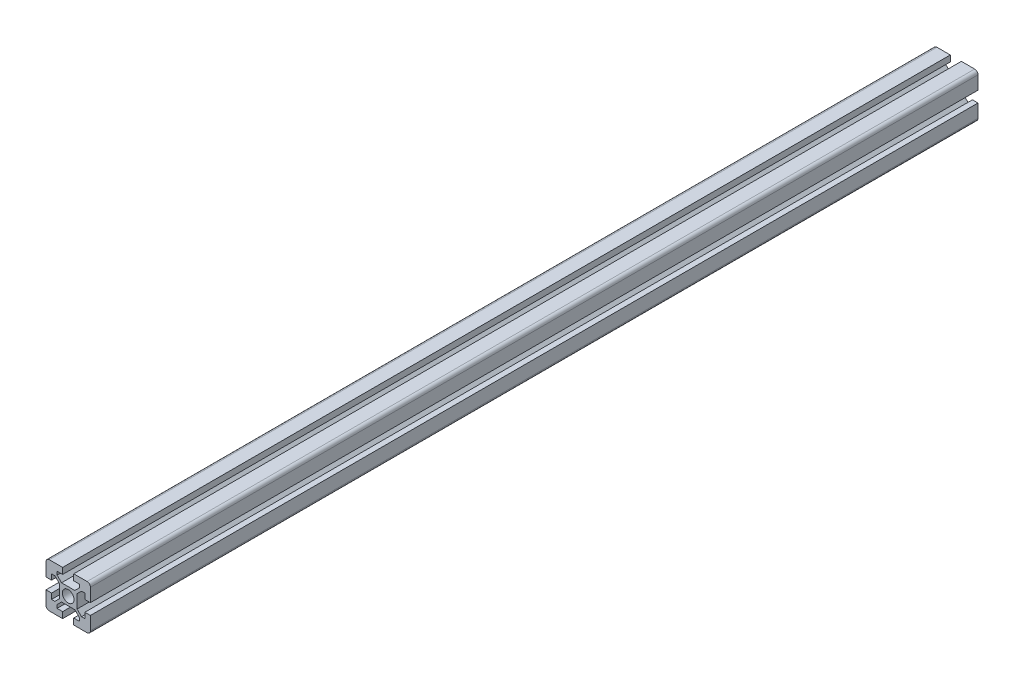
ISO-10303-21;
HEADER;
FILE_DESCRIPTION(('STEP AP214'),'2;1');
FILE_NAME('part.step','',(''),(''),'','','');
FILE_SCHEMA(('AUTOMOTIVE_DESIGN { 1 0 10303 214 1 1 1 1 }'));
ENDSEC;
DATA;
#1=APPLICATION_CONTEXT('core data for automotive mechanical design processes');
#2=APPLICATION_PROTOCOL_DEFINITION('international standard','automotive_design',2000,#1);
#3=PRODUCT_CONTEXT('',#1,'mechanical');
#4=PRODUCT('Part','Part','',(#3));
#5=PRODUCT_RELATED_PRODUCT_CATEGORY('part','',(#4));
#6=PRODUCT_DEFINITION_FORMATION('','',#4);
#7=PRODUCT_DEFINITION_CONTEXT('part definition',#1,'design');
#8=PRODUCT_DEFINITION('design','',#6,#7);
#9=PRODUCT_DEFINITION_SHAPE('','',#8);
#10=(LENGTH_UNIT() NAMED_UNIT(*) SI_UNIT(.MILLI.,.METRE.));
#11=(NAMED_UNIT(*) PLANE_ANGLE_UNIT() SI_UNIT($,.RADIAN.));
#12=(NAMED_UNIT(*) SI_UNIT($,.STERADIAN.) SOLID_ANGLE_UNIT());
#13=UNCERTAINTY_MEASURE_WITH_UNIT(LENGTH_MEASURE(1.E-05),#10,'distance_accuracy_value','');
#14=(GEOMETRIC_REPRESENTATION_CONTEXT(3) GLOBAL_UNCERTAINTY_ASSIGNED_CONTEXT((#13)) GLOBAL_UNIT_ASSIGNED_CONTEXT((#10,
#11,#12)) REPRESENTATION_CONTEXT('',''));
#15=CARTESIAN_POINT('',(0.,0.,0.));
#16=DIRECTION('',(0.,0.,1.));
#17=DIRECTION('',(1.,0.,0.));
#18=AXIS2_PLACEMENT_3D('',#15,#16,#17);
#19=CARTESIAN_POINT('',(20.,0.,800.));
#20=DIRECTION('',(0.,1.,0.));
#21=DIRECTION('',(0.,0.,1.));
#22=AXIS2_PLACEMENT_3D('',#19,#20,#21);
#23=PLANE('',#22);
#24=DIRECTION('',(1.,0.,0.));
#25=VECTOR('',#24,1.);
#26=CARTESIAN_POINT('',(20.,0.,0.));
#27=LINE('',#26,#25);
#28=CARTESIAN_POINT('',(3.00000000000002,0.,0.));
#29=VERTEX_POINT('',#28);
#30=CARTESIAN_POINT('',(15.,0.,0.));
#31=VERTEX_POINT('',#30);
#32=EDGE_CURVE('E371',#29,#31,#27,.T.);
#33=ORIENTED_EDGE('',*,*,#32,.F.);
#34=DIRECTION('',(0.,0.,-1.));
#35=VECTOR('',#34,1.);
#36=CARTESIAN_POINT('',(3.00000000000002,0.,800.));
#37=LINE('',#36,#35);
#38=CARTESIAN_POINT('',(3.00000000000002,0.,800.));
#39=VERTEX_POINT('',#38);
#40=EDGE_CURVE('E11',#39,#29,#37,.T.);
#41=ORIENTED_EDGE('',*,*,#40,.F.);
#42=DIRECTION('',(1.,0.,0.));
#43=VECTOR('',#42,1.);
#44=CARTESIAN_POINT('',(20.,0.,800.));
#45=LINE('',#44,#43);
#46=CARTESIAN_POINT('',(15.,0.,800.));
#47=VERTEX_POINT('',#46);
#48=EDGE_CURVE('E823',#39,#47,#45,.T.);
#49=ORIENTED_EDGE('',*,*,#48,.T.);
#50=DIRECTION('',(0.,0.,-1.));
#51=VECTOR('',#50,1.);
#52=CARTESIAN_POINT('',(15.,0.,800.));
#53=LINE('',#52,#51);
#54=EDGE_CURVE('E50',#47,#31,#53,.T.);
#55=ORIENTED_EDGE('',*,*,#54,.T.);
#56=EDGE_LOOP('',(#33,#41,#49,#55));
#57=FACE_BOUND('',#56,.T.);
#58=ADVANCED_FACE('F33',(#57),#23,.T.);
#59=CARTESIAN_POINT('',(3.,-3.,800.));
#60=DIRECTION('',(0.,0.,-1.));
#61=DIRECTION('',(-1.,0.,0.));
#62=AXIS2_PLACEMENT_3D('',#59,#60,#61);
#63=CYLINDRICAL_SURFACE('',#62,3.);
#64=CARTESIAN_POINT('',(3.,-3.,0.));
#65=DIRECTION('',(0.,0.,1.));
#66=DIRECTION('',(1.,0.,0.));
#67=AXIS2_PLACEMENT_3D('',#64,#65,#66);
#68=CIRCLE('',#67,3.);
#69=CARTESIAN_POINT('',(0.,-3.00000000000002,0.));
#70=VERTEX_POINT('',#69);
#71=EDGE_CURVE('E373',#29,#70,#68,.T.);
#72=ORIENTED_EDGE('',*,*,#71,.T.);
#73=DIRECTION('',(0.,0.,-1.));
#74=VECTOR('',#73,1.);
#75=CARTESIAN_POINT('',(0.,-3.00000000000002,800.));
#76=LINE('',#75,#74);
#77=CARTESIAN_POINT('',(0.,-3.00000000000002,800.));
#78=VERTEX_POINT('',#77);
#79=EDGE_CURVE('E42',#78,#70,#76,.T.);
#80=ORIENTED_EDGE('',*,*,#79,.F.);
#81=CARTESIAN_POINT('',(3.,-3.,800.));
#82=DIRECTION('',(0.,0.,1.));
#83=DIRECTION('',(1.,0.,0.));
#84=AXIS2_PLACEMENT_3D('',#81,#82,#83);
#85=CIRCLE('',#84,3.);
#86=EDGE_CURVE('E825',#39,#78,#85,.T.);
#87=ORIENTED_EDGE('',*,*,#86,.F.);
#88=ORIENTED_EDGE('',*,*,#40,.T.);
#89=EDGE_LOOP('',(#72,#80,#87,#88));
#90=FACE_BOUND('',#89,.T.);
#91=ADVANCED_FACE('F627',(#90),#63,.T.);
#92=CARTESIAN_POINT('',(0.,-64.1414213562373,800.));
#93=DIRECTION('',(1.,0.,0.));
#94=DIRECTION('',(0.,1.,0.));
#95=AXIS2_PLACEMENT_3D('',#92,#93,#94);
#96=PLANE('',#95);
#97=DIRECTION('',(0.,-1.,0.));
#98=VECTOR('',#97,1.);
#99=CARTESIAN_POINT('',(0.,-64.1414213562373,0.));
#100=LINE('',#99,#98);
#101=CARTESIAN_POINT('',(0.,-15.,0.));
#102=VERTEX_POINT('',#101);
#103=EDGE_CURVE('E376',#70,#102,#100,.T.);
#104=ORIENTED_EDGE('',*,*,#103,.T.);
#105=DIRECTION('',(0.,0.,-1.));
#106=VECTOR('',#105,1.);
#107=CARTESIAN_POINT('',(0.,-15.,800.));
#108=LINE('',#107,#106);
#109=CARTESIAN_POINT('',(0.,-15.,800.));
#110=VERTEX_POINT('',#109);
#111=EDGE_CURVE('E615',#110,#102,#108,.T.);
#112=ORIENTED_EDGE('',*,*,#111,.F.);
#113=DIRECTION('',(0.,-1.,0.));
#114=VECTOR('',#113,1.);
#115=CARTESIAN_POINT('',(0.,-64.1414213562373,800.));
#116=LINE('',#115,#114);
#117=EDGE_CURVE('E623',#78,#110,#116,.T.);
#118=ORIENTED_EDGE('',*,*,#117,.F.);
#119=ORIENTED_EDGE('',*,*,#79,.T.);
#120=EDGE_LOOP('',(#104,#112,#118,#119));
#121=FACE_BOUND('',#120,.T.);
#122=ADVANCED_FACE('F620',(#121),#96,.F.);
#123=CARTESIAN_POINT('',(20.,-15.,800.));
#124=DIRECTION('',(0.,1.,0.));
#125=DIRECTION('',(0.,0.,1.));
#126=AXIS2_PLACEMENT_3D('',#123,#124,#125);
#127=PLANE('',#126);
#128=DIRECTION('',(1.,0.,0.));
#129=VECTOR('',#128,1.);
#130=CARTESIAN_POINT('',(20.,-15.,0.));
#131=LINE('',#130,#129);
#132=CARTESIAN_POINT('',(4.99999999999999,-15.,0.));
#133=VERTEX_POINT('',#132);
#134=EDGE_CURVE('E379',#102,#133,#131,.T.);
#135=ORIENTED_EDGE('',*,*,#134,.T.);
#136=DIRECTION('',(0.,0.,-1.));
#137=VECTOR('',#136,1.);
#138=CARTESIAN_POINT('',(4.99999999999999,-15.,800.));
#139=LINE('',#138,#137);
#140=CARTESIAN_POINT('',(4.99999999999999,-15.,800.));
#141=VERTEX_POINT('',#140);
#142=EDGE_CURVE('E612',#141,#133,#139,.T.);
#143=ORIENTED_EDGE('',*,*,#142,.F.);
#144=DIRECTION('',(1.,0.,0.));
#145=VECTOR('',#144,1.);
#146=CARTESIAN_POINT('',(20.,-15.,800.));
#147=LINE('',#146,#145);
#148=EDGE_CURVE('E830',#110,#141,#147,.T.);
#149=ORIENTED_EDGE('',*,*,#148,.F.);
#150=ORIENTED_EDGE('',*,*,#111,.T.);
#151=EDGE_LOOP('',(#135,#143,#149,#150));
#152=FACE_BOUND('',#151,.T.);
#153=ADVANCED_FACE('F638',(#152),#127,.F.);
#154=CARTESIAN_POINT('',(5.,-64.1414213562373,800.));
#155=DIRECTION('',(-1.,0.,0.));
#156=DIRECTION('',(0.,-1.,0.));
#157=AXIS2_PLACEMENT_3D('',#154,#155,#156);
#158=PLANE('',#157);
#159=DIRECTION('',(0.,1.,0.));
#160=VECTOR('',#159,1.);
#161=CARTESIAN_POINT('',(5.,-64.1414213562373,0.));
#162=LINE('',#161,#160);
#163=CARTESIAN_POINT('',(4.99999999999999,-10.,0.));
#164=VERTEX_POINT('',#163);
#165=EDGE_CURVE('E382',#133,#164,#162,.T.);
#166=ORIENTED_EDGE('',*,*,#165,.T.);
#167=DIRECTION('',(0.,0.,-1.));
#168=VECTOR('',#167,1.);
#169=CARTESIAN_POINT('',(4.99999999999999,-10.,800.));
#170=LINE('',#169,#168);
#171=CARTESIAN_POINT('',(4.99999999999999,-10.,800.));
#172=VERTEX_POINT('',#171);
#173=EDGE_CURVE('E609',#172,#164,#170,.T.);
#174=ORIENTED_EDGE('',*,*,#173,.F.);
#175=DIRECTION('',(0.,1.,0.));
#176=VECTOR('',#175,1.);
#177=CARTESIAN_POINT('',(5.,-64.1414213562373,800.));
#178=LINE('',#177,#176);
#179=EDGE_CURVE('E833',#141,#172,#178,.T.);
#180=ORIENTED_EDGE('',*,*,#179,.F.);
#181=ORIENTED_EDGE('',*,*,#142,.T.);
#182=EDGE_LOOP('',(#166,#174,#180,#181));
#183=FACE_BOUND('',#182,.T.);
#184=ADVANCED_FACE('F641',(#183),#158,.F.);
#185=CARTESIAN_POINT('',(20.,-10.,800.));
#186=DIRECTION('',(0.,1.,0.));
#187=DIRECTION('',(0.,0.,1.));
#188=AXIS2_PLACEMENT_3D('',#185,#186,#187);
#189=PLANE('',#188);
#190=DIRECTION('',(1.,0.,0.));
#191=VECTOR('',#190,1.);
#192=CARTESIAN_POINT('',(20.,-10.,0.));
#193=LINE('',#192,#191);
#194=CARTESIAN_POINT('',(7.99999999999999,-10.,0.));
#195=VERTEX_POINT('',#194);
#196=EDGE_CURVE('E385',#164,#195,#193,.T.);
#197=ORIENTED_EDGE('',*,*,#196,.T.);
#198=DIRECTION('',(0.,0.,-1.));
#199=VECTOR('',#198,1.);
#200=CARTESIAN_POINT('',(7.99999999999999,-10.,800.));
#201=LINE('',#200,#199);
#202=CARTESIAN_POINT('',(7.99999999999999,-10.,800.));
#203=VERTEX_POINT('',#202);
#204=EDGE_CURVE('E606',#203,#195,#201,.T.);
#205=ORIENTED_EDGE('',*,*,#204,.F.);
#206=DIRECTION('',(1.,0.,0.));
#207=VECTOR('',#206,1.);
#208=CARTESIAN_POINT('',(20.,-10.,800.));
#209=LINE('',#208,#207);
#210=EDGE_CURVE('E836',#172,#203,#209,.T.);
#211=ORIENTED_EDGE('',*,*,#210,.F.);
#212=ORIENTED_EDGE('',*,*,#173,.T.);
#213=EDGE_LOOP('',(#197,#205,#211,#212));
#214=FACE_BOUND('',#213,.T.);
#215=ADVANCED_FACE('F645',(#214),#189,.F.);
#216=CARTESIAN_POINT('',(41.0707106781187,-43.0707106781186,800.));
#217=DIRECTION('',(0.707106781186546,0.707106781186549,0.));
#218=DIRECTION('',(-0.707106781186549,0.707106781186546,0.));
#219=AXIS2_PLACEMENT_3D('',#216,#217,#218);
#220=PLANE('',#219);
#221=DIRECTION('',(0.707106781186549,-0.707106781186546,0.));
#222=VECTOR('',#221,1.);
#223=CARTESIAN_POINT('',(41.0707106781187,-43.0707106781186,0.));
#224=LINE('',#223,#222);
#225=CARTESIAN_POINT('',(12.,-14.,0.));
#226=VERTEX_POINT('',#225);
#227=EDGE_CURVE('E388',#195,#226,#224,.T.);
#228=ORIENTED_EDGE('',*,*,#227,.T.);
#229=DIRECTION('',(0.,0.,-1.));
#230=VECTOR('',#229,1.);
#231=CARTESIAN_POINT('',(12.,-14.,800.));
#232=LINE('',#231,#230);
#233=CARTESIAN_POINT('',(12.,-14.,800.));
#234=VERTEX_POINT('',#233);
#235=EDGE_CURVE('E603',#234,#226,#232,.T.);
#236=ORIENTED_EDGE('',*,*,#235,.F.);
#237=DIRECTION('',(0.707106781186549,-0.707106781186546,0.));
#238=VECTOR('',#237,1.);
#239=CARTESIAN_POINT('',(41.0707106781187,-43.0707106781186,800.));
#240=LINE('',#239,#238);
#241=EDGE_CURVE('E839',#203,#234,#240,.T.);
#242=ORIENTED_EDGE('',*,*,#241,.F.);
#243=ORIENTED_EDGE('',*,*,#204,.T.);
#244=EDGE_LOOP('',(#228,#236,#242,#243));
#245=FACE_BOUND('',#244,.T.);
#246=ADVANCED_FACE('F649',(#245),#220,.F.);
#247=CARTESIAN_POINT('',(12.,-64.1414213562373,800.));
#248=DIRECTION('',(1.,0.,0.));
#249=DIRECTION('',(0.,1.,0.));
#250=AXIS2_PLACEMENT_3D('',#247,#248,#249);
#251=PLANE('',#250);
#252=DIRECTION('',(0.,-1.,0.));
#253=VECTOR('',#252,1.);
#254=CARTESIAN_POINT('',(12.,-64.1414213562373,0.));
#255=LINE('',#254,#253);
#256=CARTESIAN_POINT('',(12.,-26.,0.));
#257=VERTEX_POINT('',#256);
#258=EDGE_CURVE('E391',#226,#257,#255,.T.);
#259=ORIENTED_EDGE('',*,*,#258,.T.);
#260=DIRECTION('',(0.,0.,-1.));
#261=VECTOR('',#260,1.);
#262=CARTESIAN_POINT('',(12.,-26.,800.));
#263=LINE('',#262,#261);
#264=CARTESIAN_POINT('',(12.,-26.,800.));
#265=VERTEX_POINT('',#264);
#266=EDGE_CURVE('E600',#265,#257,#263,.T.);
#267=ORIENTED_EDGE('',*,*,#266,.F.);
#268=DIRECTION('',(0.,-1.,0.));
#269=VECTOR('',#268,1.);
#270=CARTESIAN_POINT('',(12.,-64.1414213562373,800.));
#271=LINE('',#270,#269);
#272=EDGE_CURVE('E842',#234,#265,#271,.T.);
#273=ORIENTED_EDGE('',*,*,#272,.F.);
#274=ORIENTED_EDGE('',*,*,#235,.T.);
#275=EDGE_LOOP('',(#259,#267,#273,#274));
#276=FACE_BOUND('',#275,.T.);
#277=ADVANCED_FACE('F653',(#276),#251,.F.);
#278=CARTESIAN_POINT('',(-3.07071067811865,-41.0707106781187,800.));
#279=DIRECTION('',(0.707106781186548,-0.707106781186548,0.));
#280=DIRECTION('',(0.707106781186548,0.707106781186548,0.));
#281=AXIS2_PLACEMENT_3D('',#278,#279,#280);
#282=PLANE('',#281);
#283=DIRECTION('',(-0.707106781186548,-0.707106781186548,0.));
#284=VECTOR('',#283,1.);
#285=CARTESIAN_POINT('',(-3.07071067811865,-41.0707106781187,0.));
#286=LINE('',#285,#284);
#287=CARTESIAN_POINT('',(8.00000000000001,-30.,0.));
#288=VERTEX_POINT('',#287);
#289=EDGE_CURVE('E394',#257,#288,#286,.T.);
#290=ORIENTED_EDGE('',*,*,#289,.T.);
#291=DIRECTION('',(0.,0.,-1.));
#292=VECTOR('',#291,1.);
#293=CARTESIAN_POINT('',(8.00000000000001,-30.,800.));
#294=LINE('',#293,#292);
#295=CARTESIAN_POINT('',(8.00000000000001,-30.,800.));
#296=VERTEX_POINT('',#295);
#297=EDGE_CURVE('E597',#296,#288,#294,.T.);
#298=ORIENTED_EDGE('',*,*,#297,.F.);
#299=DIRECTION('',(-0.707106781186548,-0.707106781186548,0.));
#300=VECTOR('',#299,1.);
#301=CARTESIAN_POINT('',(-3.07071067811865,-41.0707106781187,800.));
#302=LINE('',#301,#300);
#303=EDGE_CURVE('E845',#265,#296,#302,.T.);
#304=ORIENTED_EDGE('',*,*,#303,.F.);
#305=ORIENTED_EDGE('',*,*,#266,.T.);
#306=EDGE_LOOP('',(#290,#298,#304,#305));
#307=FACE_BOUND('',#306,.T.);
#308=ADVANCED_FACE('F657',(#307),#282,.F.);
#309=CARTESIAN_POINT('',(20.,-30.,800.));
#310=DIRECTION('',(0.,-1.,0.));
#311=DIRECTION('',(0.,0.,-1.));
#312=AXIS2_PLACEMENT_3D('',#309,#310,#311);
#313=PLANE('',#312);
#314=DIRECTION('',(-1.,0.,0.));
#315=VECTOR('',#314,1.);
#316=CARTESIAN_POINT('',(20.,-30.,0.));
#317=LINE('',#316,#315);
#318=CARTESIAN_POINT('',(5.,-30.,0.));
#319=VERTEX_POINT('',#318);
#320=EDGE_CURVE('E397',#288,#319,#317,.T.);
#321=ORIENTED_EDGE('',*,*,#320,.T.);
#322=DIRECTION('',(0.,0.,-1.));
#323=VECTOR('',#322,1.);
#324=CARTESIAN_POINT('',(5.,-30.,800.));
#325=LINE('',#324,#323);
#326=CARTESIAN_POINT('',(5.,-30.,800.));
#327=VERTEX_POINT('',#326);
#328=EDGE_CURVE('E594',#327,#319,#325,.T.);
#329=ORIENTED_EDGE('',*,*,#328,.F.);
#330=DIRECTION('',(-1.,0.,0.));
#331=VECTOR('',#330,1.);
#332=CARTESIAN_POINT('',(20.,-30.,800.));
#333=LINE('',#332,#331);
#334=EDGE_CURVE('E848',#296,#327,#333,.T.);
#335=ORIENTED_EDGE('',*,*,#334,.F.);
#336=ORIENTED_EDGE('',*,*,#297,.T.);
#337=EDGE_LOOP('',(#321,#329,#335,#336));
#338=FACE_BOUND('',#337,.T.);
#339=ADVANCED_FACE('F661',(#338),#313,.F.);
#340=CARTESIAN_POINT('',(5.,-64.1414213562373,800.));
#341=DIRECTION('',(-1.,0.,0.));
#342=DIRECTION('',(0.,0.,1.));
#343=AXIS2_PLACEMENT_3D('',#340,#341,#342);
#344=PLANE('',#343);
#345=DIRECTION('',(0.,1.,0.));
#346=VECTOR('',#345,1.);
#347=CARTESIAN_POINT('',(5.,-64.1414213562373,0.));
#348=LINE('',#347,#346);
#349=CARTESIAN_POINT('',(5.,-25.,0.));
#350=VERTEX_POINT('',#349);
#351=EDGE_CURVE('E400',#319,#350,#348,.T.);
#352=ORIENTED_EDGE('',*,*,#351,.T.);
#353=DIRECTION('',(0.,0.,-1.));
#354=VECTOR('',#353,1.);
#355=CARTESIAN_POINT('',(5.,-25.,800.));
#356=LINE('',#355,#354);
#357=CARTESIAN_POINT('',(5.,-25.,800.));
#358=VERTEX_POINT('',#357);
#359=EDGE_CURVE('E592',#358,#350,#356,.T.);
#360=ORIENTED_EDGE('',*,*,#359,.F.);
#361=DIRECTION('',(0.,1.,0.));
#362=VECTOR('',#361,1.);
#363=CARTESIAN_POINT('',(5.,-64.1414213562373,800.));
#364=LINE('',#363,#362);
#365=EDGE_CURVE('E851',#327,#358,#364,.T.);
#366=ORIENTED_EDGE('',*,*,#365,.F.);
#367=ORIENTED_EDGE('',*,*,#328,.T.);
#368=EDGE_LOOP('',(#352,#360,#366,#367));
#369=FACE_BOUND('',#368,.T.);
#370=ADVANCED_FACE('F665',(#369),#344,.F.);
#371=CARTESIAN_POINT('',(20.,-25.,800.));
#372=DIRECTION('',(0.,1.,0.));
#373=DIRECTION('',(0.,0.,1.));
#374=AXIS2_PLACEMENT_3D('',#371,#372,#373);
#375=PLANE('',#374);
#376=DIRECTION('',(1.,0.,0.));
#377=VECTOR('',#376,1.);
#378=CARTESIAN_POINT('',(20.,-25.,0.));
#379=LINE('',#378,#377);
#380=CARTESIAN_POINT('',(0.,-25.,0.));
#381=VERTEX_POINT('',#380);
#382=EDGE_CURVE('E403',#381,#350,#379,.T.);
#383=ORIENTED_EDGE('',*,*,#382,.F.);
#384=DIRECTION('',(0.,0.,-1.));
#385=VECTOR('',#384,1.);
#386=CARTESIAN_POINT('',(0.,-25.,800.));
#387=LINE('',#386,#385);
#388=CARTESIAN_POINT('',(0.,-25.,800.));
#389=VERTEX_POINT('',#388);
#390=EDGE_CURVE('E590',#389,#381,#387,.T.);
#391=ORIENTED_EDGE('',*,*,#390,.F.);
#392=DIRECTION('',(1.,0.,0.));
#393=VECTOR('',#392,1.);
#394=CARTESIAN_POINT('',(20.,-25.,800.));
#395=LINE('',#394,#393);
#396=EDGE_CURVE('E853',#389,#358,#395,.T.);
#397=ORIENTED_EDGE('',*,*,#396,.T.);
#398=ORIENTED_EDGE('',*,*,#359,.T.);
#399=EDGE_LOOP('',(#383,#391,#397,#398));
#400=FACE_BOUND('',#399,.T.);
#401=ADVANCED_FACE('F669',(#400),#375,.T.);
#402=CARTESIAN_POINT('',(0.,-64.1414213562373,800.));
#403=DIRECTION('',(1.,0.,0.));
#404=DIRECTION('',(0.,1.,0.));
#405=AXIS2_PLACEMENT_3D('',#402,#403,#404);
#406=PLANE('',#405);
#407=DIRECTION('',(0.,-1.,0.));
#408=VECTOR('',#407,1.);
#409=CARTESIAN_POINT('',(0.,-64.1414213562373,0.));
#410=LINE('',#409,#408);
#411=CARTESIAN_POINT('',(0.,-37.,0.));
#412=VERTEX_POINT('',#411);
#413=EDGE_CURVE('E406',#381,#412,#410,.T.);
#414=ORIENTED_EDGE('',*,*,#413,.T.);
#415=DIRECTION('',(0.,0.,-1.));
#416=VECTOR('',#415,1.);
#417=CARTESIAN_POINT('',(0.,-37.,800.));
#418=LINE('',#417,#416);
#419=CARTESIAN_POINT('',(0.,-37.,800.));
#420=VERTEX_POINT('',#419);
#421=EDGE_CURVE('E587',#420,#412,#418,.T.);
#422=ORIENTED_EDGE('',*,*,#421,.F.);
#423=DIRECTION('',(0.,-1.,0.));
#424=VECTOR('',#423,1.);
#425=CARTESIAN_POINT('',(0.,-64.1414213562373,800.));
#426=LINE('',#425,#424);
#427=EDGE_CURVE('E856',#389,#420,#426,.T.);
#428=ORIENTED_EDGE('',*,*,#427,.F.);
#429=ORIENTED_EDGE('',*,*,#390,.T.);
#430=EDGE_LOOP('',(#414,#422,#428,#429));
#431=FACE_BOUND('',#430,.T.);
#432=ADVANCED_FACE('F673',(#431),#406,.F.);
#433=CARTESIAN_POINT('',(3.,-37.,800.));
#434=DIRECTION('',(0.,0.,-1.));
#435=DIRECTION('',(-1.,0.,0.));
#436=AXIS2_PLACEMENT_3D('',#433,#434,#435);
#437=CYLINDRICAL_SURFACE('',#436,3.);
#438=CARTESIAN_POINT('',(3.,-37.,0.));
#439=DIRECTION('',(0.,0.,1.));
#440=DIRECTION('',(1.,0.,0.));
#441=AXIS2_PLACEMENT_3D('',#438,#439,#440);
#442=CIRCLE('',#441,3.);
#443=CARTESIAN_POINT('',(3.00000000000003,-40.,0.));
#444=VERTEX_POINT('',#443);
#445=EDGE_CURVE('E409',#412,#444,#442,.T.);
#446=ORIENTED_EDGE('',*,*,#445,.T.);
#447=DIRECTION('',(0.,0.,-1.));
#448=VECTOR('',#447,1.);
#449=CARTESIAN_POINT('',(3.00000000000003,-40.,800.));
#450=LINE('',#449,#448);
#451=CARTESIAN_POINT('',(3.00000000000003,-40.,800.));
#452=VERTEX_POINT('',#451);
#453=EDGE_CURVE('E584',#452,#444,#450,.T.);
#454=ORIENTED_EDGE('',*,*,#453,.F.);
#455=CARTESIAN_POINT('',(3.,-37.,800.));
#456=DIRECTION('',(0.,0.,1.));
#457=DIRECTION('',(1.,0.,0.));
#458=AXIS2_PLACEMENT_3D('',#455,#456,#457);
#459=CIRCLE('',#458,3.);
#460=EDGE_CURVE('E859',#420,#452,#459,.T.);
#461=ORIENTED_EDGE('',*,*,#460,.F.);
#462=ORIENTED_EDGE('',*,*,#421,.T.);
#463=EDGE_LOOP('',(#446,#454,#461,#462));
#464=FACE_BOUND('',#463,.T.);
#465=ADVANCED_FACE('F677',(#464),#437,.T.);
#466=CARTESIAN_POINT('',(20.,-40.,800.));
#467=DIRECTION('',(0.,1.,0.));
#468=DIRECTION('',(0.,0.,1.));
#469=AXIS2_PLACEMENT_3D('',#466,#467,#468);
#470=PLANE('',#469);
#471=DIRECTION('',(1.,0.,0.));
#472=VECTOR('',#471,1.);
#473=CARTESIAN_POINT('',(20.,-40.,0.));
#474=LINE('',#473,#472);
#475=CARTESIAN_POINT('',(15.,-40.,0.));
#476=VERTEX_POINT('',#475);
#477=EDGE_CURVE('E412',#444,#476,#474,.T.);
#478=ORIENTED_EDGE('',*,*,#477,.T.);
#479=DIRECTION('',(0.,0.,-1.));
#480=VECTOR('',#479,1.);
#481=CARTESIAN_POINT('',(15.,-40.,800.));
#482=LINE('',#481,#480);
#483=CARTESIAN_POINT('',(15.,-40.,800.));
#484=VERTEX_POINT('',#483);
#485=EDGE_CURVE('E581',#484,#476,#482,.T.);
#486=ORIENTED_EDGE('',*,*,#485,.F.);
#487=DIRECTION('',(1.,0.,0.));
#488=VECTOR('',#487,1.);
#489=CARTESIAN_POINT('',(20.,-40.,800.));
#490=LINE('',#489,#488);
#491=EDGE_CURVE('E862',#452,#484,#490,.T.);
#492=ORIENTED_EDGE('',*,*,#491,.F.);
#493=ORIENTED_EDGE('',*,*,#453,.T.);
#494=EDGE_LOOP('',(#478,#486,#492,#493));
#495=FACE_BOUND('',#494,.T.);
#496=ADVANCED_FACE('F681',(#495),#470,.F.);
#497=CARTESIAN_POINT('',(15.,-64.1414213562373,800.));
#498=DIRECTION('',(-1.,0.,0.));
#499=DIRECTION('',(0.,-1.,0.));
#500=AXIS2_PLACEMENT_3D('',#497,#498,#499);
#501=PLANE('',#500);
#502=DIRECTION('',(0.,1.,0.));
#503=VECTOR('',#502,1.);
#504=CARTESIAN_POINT('',(15.,-64.1414213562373,0.));
#505=LINE('',#504,#503);
#506=CARTESIAN_POINT('',(15.,-34.5,0.));
#507=VERTEX_POINT('',#506);
#508=EDGE_CURVE('E415',#476,#507,#505,.T.);
#509=ORIENTED_EDGE('',*,*,#508,.T.);
#510=DIRECTION('',(0.,0.,-1.));
#511=VECTOR('',#510,1.);
#512=CARTESIAN_POINT('',(15.,-34.5,800.));
#513=LINE('',#512,#511);
#514=CARTESIAN_POINT('',(15.,-34.5,800.));
#515=VERTEX_POINT('',#514);
#516=EDGE_CURVE('E578',#515,#507,#513,.T.);
#517=ORIENTED_EDGE('',*,*,#516,.F.);
#518=DIRECTION('',(0.,1.,0.));
#519=VECTOR('',#518,1.);
#520=CARTESIAN_POINT('',(15.,-64.1414213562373,800.));
#521=LINE('',#520,#519);
#522=EDGE_CURVE('E865',#484,#515,#521,.T.);
#523=ORIENTED_EDGE('',*,*,#522,.F.);
#524=ORIENTED_EDGE('',*,*,#485,.T.);
#525=EDGE_LOOP('',(#509,#517,#523,#524));
#526=FACE_BOUND('',#525,.T.);
#527=ADVANCED_FACE('F685',(#526),#501,.F.);
#528=CARTESIAN_POINT('',(20.,-34.5,800.));
#529=DIRECTION('',(0.,-1.,0.));
#530=DIRECTION('',(0.,0.,-1.));
#531=AXIS2_PLACEMENT_3D('',#528,#529,#530);
#532=PLANE('',#531);
#533=DIRECTION('',(-1.,0.,0.));
#534=VECTOR('',#533,1.);
#535=CARTESIAN_POINT('',(20.,-34.5,0.));
#536=LINE('',#535,#534);
#537=CARTESIAN_POINT('',(10.,-34.5,0.));
#538=VERTEX_POINT('',#537);
#539=EDGE_CURVE('E418',#507,#538,#536,.T.);
#540=ORIENTED_EDGE('',*,*,#539,.T.);
#541=DIRECTION('',(0.,0.,-1.));
#542=VECTOR('',#541,1.);
#543=CARTESIAN_POINT('',(10.,-34.5,800.));
#544=LINE('',#543,#542);
#545=CARTESIAN_POINT('',(10.,-34.5,800.));
#546=VERTEX_POINT('',#545);
#547=EDGE_CURVE('E575',#546,#538,#544,.T.);
#548=ORIENTED_EDGE('',*,*,#547,.F.);
#549=DIRECTION('',(-1.,0.,0.));
#550=VECTOR('',#549,1.);
#551=CARTESIAN_POINT('',(20.,-34.5,800.));
#552=LINE('',#551,#550);
#553=EDGE_CURVE('E868',#515,#546,#552,.T.);
#554=ORIENTED_EDGE('',*,*,#553,.F.);
#555=ORIENTED_EDGE('',*,*,#516,.T.);
#556=EDGE_LOOP('',(#540,#548,#554,#555));
#557=FACE_BOUND('',#556,.T.);
#558=ADVANCED_FACE('F689',(#557),#532,.F.);
#559=CARTESIAN_POINT('',(10.,-64.1414213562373,800.));
#560=DIRECTION('',(-1.,0.,0.));
#561=DIRECTION('',(0.,0.,1.));
#562=AXIS2_PLACEMENT_3D('',#559,#560,#561);
#563=PLANE('',#562);
#564=DIRECTION('',(0.,1.,0.));
#565=VECTOR('',#564,1.);
#566=CARTESIAN_POINT('',(10.,-64.1414213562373,0.));
#567=LINE('',#566,#565);
#568=CARTESIAN_POINT('',(10.,-31.5,0.));
#569=VERTEX_POINT('',#568);
#570=EDGE_CURVE('E421',#538,#569,#567,.T.);
#571=ORIENTED_EDGE('',*,*,#570,.T.);
#572=DIRECTION('',(0.,0.,-1.));
#573=VECTOR('',#572,1.);
#574=CARTESIAN_POINT('',(10.,-31.5,800.));
#575=LINE('',#574,#573);
#576=CARTESIAN_POINT('',(10.,-31.5,800.));
#577=VERTEX_POINT('',#576);
#578=EDGE_CURVE('E572',#577,#569,#575,.T.);
#579=ORIENTED_EDGE('',*,*,#578,.F.);
#580=DIRECTION('',(0.,1.,0.));
#581=VECTOR('',#580,1.);
#582=CARTESIAN_POINT('',(10.,-64.1414213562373,800.));
#583=LINE('',#582,#581);
#584=EDGE_CURVE('E871',#546,#577,#583,.T.);
#585=ORIENTED_EDGE('',*,*,#584,.F.);
#586=ORIENTED_EDGE('',*,*,#547,.T.);
#587=EDGE_LOOP('',(#571,#579,#585,#586));
#588=FACE_BOUND('',#587,.T.);
#589=ADVANCED_FACE('F693',(#588),#563,.F.);
#590=CARTESIAN_POINT('',(-1.32071067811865,-42.8207106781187,800.));
#591=DIRECTION('',(-0.707106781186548,0.707106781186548,0.));
#592=DIRECTION('',(-0.707106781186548,-0.707106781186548,0.));
#593=AXIS2_PLACEMENT_3D('',#590,#591,#592);
#594=PLANE('',#593);
#595=DIRECTION('',(0.707106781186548,0.707106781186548,0.));
#596=VECTOR('',#595,1.);
#597=CARTESIAN_POINT('',(-1.32071067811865,-42.8207106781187,0.));
#598=LINE('',#597,#596);
#599=CARTESIAN_POINT('',(14.,-27.5,0.));
#600=VERTEX_POINT('',#599);
#601=EDGE_CURVE('E424',#569,#600,#598,.T.);
#602=ORIENTED_EDGE('',*,*,#601,.T.);
#603=DIRECTION('',(0.,0.,-1.));
#604=VECTOR('',#603,1.);
#605=CARTESIAN_POINT('',(14.,-27.5,800.));
#606=LINE('',#605,#604);
#607=CARTESIAN_POINT('',(14.,-27.5,800.));
#608=VERTEX_POINT('',#607);
#609=EDGE_CURVE('E569',#608,#600,#606,.T.);
#610=ORIENTED_EDGE('',*,*,#609,.F.);
#611=DIRECTION('',(0.707106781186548,0.707106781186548,0.));
#612=VECTOR('',#611,1.);
#613=CARTESIAN_POINT('',(-1.32071067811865,-42.8207106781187,800.));
#614=LINE('',#613,#612);
#615=EDGE_CURVE('E874',#577,#608,#614,.T.);
#616=ORIENTED_EDGE('',*,*,#615,.F.);
#617=ORIENTED_EDGE('',*,*,#578,.T.);
#618=EDGE_LOOP('',(#602,#610,#616,#617));
#619=FACE_BOUND('',#618,.T.);
#620=ADVANCED_FACE('F697',(#619),#594,.F.);
#621=CARTESIAN_POINT('',(20.,-27.5,800.));
#622=DIRECTION('',(0.,1.,0.));
#623=DIRECTION('',(0.,0.,1.));
#624=AXIS2_PLACEMENT_3D('',#621,#622,#623);
#625=PLANE('',#624);
#626=DIRECTION('',(1.,0.,0.));
#627=VECTOR('',#626,1.);
#628=CARTESIAN_POINT('',(20.,-27.5,0.));
#629=LINE('',#628,#627);
#630=CARTESIAN_POINT('',(26.,-27.5,0.));
#631=VERTEX_POINT('',#630);
#632=EDGE_CURVE('E427',#600,#631,#629,.T.);
#633=ORIENTED_EDGE('',*,*,#632,.T.);
#634=DIRECTION('',(0.,0.,-1.));
#635=VECTOR('',#634,1.);
#636=CARTESIAN_POINT('',(26.,-27.5,800.));
#637=LINE('',#636,#635);
#638=CARTESIAN_POINT('',(26.,-27.5,800.));
#639=VERTEX_POINT('',#638);
#640=EDGE_CURVE('E566',#639,#631,#637,.T.);
#641=ORIENTED_EDGE('',*,*,#640,.F.);
#642=DIRECTION('',(1.,0.,0.));
#643=VECTOR('',#642,1.);
#644=CARTESIAN_POINT('',(20.,-27.5,800.));
#645=LINE('',#644,#643);
#646=EDGE_CURVE('E877',#608,#639,#645,.T.);
#647=ORIENTED_EDGE('',*,*,#646,.F.);
#648=ORIENTED_EDGE('',*,*,#609,.T.);
#649=EDGE_LOOP('',(#633,#641,#647,#648));
#650=FACE_BOUND('',#649,.T.);
#651=ADVANCED_FACE('F701',(#650),#625,.F.);
#652=CARTESIAN_POINT('',(41.3207106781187,-42.8207106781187,800.));
#653=DIRECTION('',(0.707106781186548,0.707106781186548,0.));
#654=DIRECTION('',(-0.707106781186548,0.707106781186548,0.));
#655=AXIS2_PLACEMENT_3D('',#652,#653,#654);
#656=PLANE('',#655);
#657=DIRECTION('',(0.707106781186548,-0.707106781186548,0.));
#658=VECTOR('',#657,1.);
#659=CARTESIAN_POINT('',(41.3207106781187,-42.8207106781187,0.));
#660=LINE('',#659,#658);
#661=CARTESIAN_POINT('',(30.,-31.5,0.));
#662=VERTEX_POINT('',#661);
#663=EDGE_CURVE('E430',#631,#662,#660,.T.);
#664=ORIENTED_EDGE('',*,*,#663,.T.);
#665=DIRECTION('',(0.,0.,-1.));
#666=VECTOR('',#665,1.);
#667=CARTESIAN_POINT('',(30.,-31.5,800.));
#668=LINE('',#667,#666);
#669=CARTESIAN_POINT('',(30.,-31.5,800.));
#670=VERTEX_POINT('',#669);
#671=EDGE_CURVE('E563',#670,#662,#668,.T.);
#672=ORIENTED_EDGE('',*,*,#671,.F.);
#673=DIRECTION('',(0.707106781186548,-0.707106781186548,0.));
#674=VECTOR('',#673,1.);
#675=CARTESIAN_POINT('',(41.3207106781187,-42.8207106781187,800.));
#676=LINE('',#675,#674);
#677=EDGE_CURVE('E880',#639,#670,#676,.T.);
#678=ORIENTED_EDGE('',*,*,#677,.F.);
#679=ORIENTED_EDGE('',*,*,#640,.T.);
#680=EDGE_LOOP('',(#664,#672,#678,#679));
#681=FACE_BOUND('',#680,.T.);
#682=ADVANCED_FACE('F705',(#681),#656,.F.);
#683=CARTESIAN_POINT('',(30.,-64.1414213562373,800.));
#684=DIRECTION('',(1.,0.,0.));
#685=DIRECTION('',(0.,0.,-1.));
#686=AXIS2_PLACEMENT_3D('',#683,#684,#685);
#687=PLANE('',#686);
#688=DIRECTION('',(0.,-1.,0.));
#689=VECTOR('',#688,1.);
#690=CARTESIAN_POINT('',(30.,-64.1414213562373,0.));
#691=LINE('',#690,#689);
#692=CARTESIAN_POINT('',(30.,-34.5,0.));
#693=VERTEX_POINT('',#692);
#694=EDGE_CURVE('E433',#662,#693,#691,.T.);
#695=ORIENTED_EDGE('',*,*,#694,.T.);
#696=DIRECTION('',(0.,0.,-1.));
#697=VECTOR('',#696,1.);
#698=CARTESIAN_POINT('',(30.,-34.5,800.));
#699=LINE('',#698,#697);
#700=CARTESIAN_POINT('',(30.,-34.5,800.));
#701=VERTEX_POINT('',#700);
#702=EDGE_CURVE('E560',#701,#693,#699,.T.);
#703=ORIENTED_EDGE('',*,*,#702,.F.);
#704=DIRECTION('',(0.,-1.,0.));
#705=VECTOR('',#704,1.);
#706=CARTESIAN_POINT('',(30.,-64.1414213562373,800.));
#707=LINE('',#706,#705);
#708=EDGE_CURVE('E883',#670,#701,#707,.T.);
#709=ORIENTED_EDGE('',*,*,#708,.F.);
#710=ORIENTED_EDGE('',*,*,#671,.T.);
#711=EDGE_LOOP('',(#695,#703,#709,#710));
#712=FACE_BOUND('',#711,.T.);
#713=ADVANCED_FACE('F709',(#712),#687,.F.);
#714=CARTESIAN_POINT('',(20.,-34.5,800.));
#715=DIRECTION('',(0.,-1.,0.));
#716=DIRECTION('',(1.,0.,0.));
#717=AXIS2_PLACEMENT_3D('',#714,#715,#716);
#718=PLANE('',#717);
#719=DIRECTION('',(-1.,0.,0.));
#720=VECTOR('',#719,1.);
#721=CARTESIAN_POINT('',(20.,-34.5,0.));
#722=LINE('',#721,#720);
#723=CARTESIAN_POINT('',(25.,-34.5,0.));
#724=VERTEX_POINT('',#723);
#725=EDGE_CURVE('E436',#693,#724,#722,.T.);
#726=ORIENTED_EDGE('',*,*,#725,.T.);
#727=DIRECTION('',(0.,0.,-1.));
#728=VECTOR('',#727,1.);
#729=CARTESIAN_POINT('',(25.,-34.5,800.));
#730=LINE('',#729,#728);
#731=CARTESIAN_POINT('',(25.,-34.5,800.));
#732=VERTEX_POINT('',#731);
#733=EDGE_CURVE('E558',#732,#724,#730,.T.);
#734=ORIENTED_EDGE('',*,*,#733,.F.);
#735=DIRECTION('',(-1.,0.,0.));
#736=VECTOR('',#735,1.);
#737=CARTESIAN_POINT('',(20.,-34.5,800.));
#738=LINE('',#737,#736);
#739=EDGE_CURVE('E886',#701,#732,#738,.T.);
#740=ORIENTED_EDGE('',*,*,#739,.F.);
#741=ORIENTED_EDGE('',*,*,#702,.T.);
#742=EDGE_LOOP('',(#726,#734,#740,#741));
#743=FACE_BOUND('',#742,.T.);
#744=ADVANCED_FACE('F713',(#743),#718,.F.);
#745=CARTESIAN_POINT('',(25.,-64.1414213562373,800.));
#746=DIRECTION('',(-1.,0.,0.));
#747=DIRECTION('',(0.,0.,1.));
#748=AXIS2_PLACEMENT_3D('',#745,#746,#747);
#749=PLANE('',#748);
#750=DIRECTION('',(0.,1.,0.));
#751=VECTOR('',#750,1.);
#752=CARTESIAN_POINT('',(25.,-64.1414213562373,0.));
#753=LINE('',#752,#751);
#754=CARTESIAN_POINT('',(25.,-40.,0.));
#755=VERTEX_POINT('',#754);
#756=EDGE_CURVE('E439',#755,#724,#753,.T.);
#757=ORIENTED_EDGE('',*,*,#756,.F.);
#758=DIRECTION('',(0.,0.,-1.));
#759=VECTOR('',#758,1.);
#760=CARTESIAN_POINT('',(25.,-40.,800.));
#761=LINE('',#760,#759);
#762=CARTESIAN_POINT('',(25.,-40.,800.));
#763=VERTEX_POINT('',#762);
#764=EDGE_CURVE('E556',#763,#755,#761,.T.);
#765=ORIENTED_EDGE('',*,*,#764,.F.);
#766=DIRECTION('',(0.,1.,0.));
#767=VECTOR('',#766,1.);
#768=CARTESIAN_POINT('',(25.,-64.1414213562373,800.));
#769=LINE('',#768,#767);
#770=EDGE_CURVE('E888',#763,#732,#769,.T.);
#771=ORIENTED_EDGE('',*,*,#770,.T.);
#772=ORIENTED_EDGE('',*,*,#733,.T.);
#773=EDGE_LOOP('',(#757,#765,#771,#772));
#774=FACE_BOUND('',#773,.T.);
#775=ADVANCED_FACE('F717',(#774),#749,.T.);
#776=CARTESIAN_POINT('',(20.,-40.,800.));
#777=DIRECTION('',(0.,1.,0.));
#778=DIRECTION('',(0.,0.,1.));
#779=AXIS2_PLACEMENT_3D('',#776,#777,#778);
#780=PLANE('',#779);
#781=DIRECTION('',(1.,0.,0.));
#782=VECTOR('',#781,1.);
#783=CARTESIAN_POINT('',(20.,-40.,0.));
#784=LINE('',#783,#782);
#785=CARTESIAN_POINT('',(37.,-40.,0.));
#786=VERTEX_POINT('',#785);
#787=EDGE_CURVE('E442',#755,#786,#784,.T.);
#788=ORIENTED_EDGE('',*,*,#787,.T.);
#789=DIRECTION('',(0.,0.,-1.));
#790=VECTOR('',#789,1.);
#791=CARTESIAN_POINT('',(37.,-40.,800.));
#792=LINE('',#791,#790);
#793=CARTESIAN_POINT('',(37.,-40.,800.));
#794=VERTEX_POINT('',#793);
#795=EDGE_CURVE('E553',#794,#786,#792,.T.);
#796=ORIENTED_EDGE('',*,*,#795,.F.);
#797=DIRECTION('',(1.,0.,0.));
#798=VECTOR('',#797,1.);
#799=CARTESIAN_POINT('',(20.,-40.,800.));
#800=LINE('',#799,#798);
#801=EDGE_CURVE('E891',#763,#794,#800,.T.);
#802=ORIENTED_EDGE('',*,*,#801,.F.);
#803=ORIENTED_EDGE('',*,*,#764,.T.);
#804=EDGE_LOOP('',(#788,#796,#802,#803));
#805=FACE_BOUND('',#804,.T.);
#806=ADVANCED_FACE('F721',(#805),#780,.F.);
#807=CARTESIAN_POINT('',(37.,-37.,800.));
#808=DIRECTION('',(0.,0.,-1.));
#809=DIRECTION('',(-1.,0.,0.));
#810=AXIS2_PLACEMENT_3D('',#807,#808,#809);
#811=CYLINDRICAL_SURFACE('',#810,3.);
#812=CARTESIAN_POINT('',(37.,-37.,0.));
#813=DIRECTION('',(0.,0.,1.));
#814=DIRECTION('',(1.,0.,0.));
#815=AXIS2_PLACEMENT_3D('',#812,#813,#814);
#816=CIRCLE('',#815,3.);
#817=CARTESIAN_POINT('',(40.,-37.,0.));
#818=VERTEX_POINT('',#817);
#819=EDGE_CURVE('E445',#786,#818,#816,.T.);
#820=ORIENTED_EDGE('',*,*,#819,.T.);
#821=DIRECTION('',(0.,0.,-1.));
#822=VECTOR('',#821,1.);
#823=CARTESIAN_POINT('',(40.,-37.,800.));
#824=LINE('',#823,#822);
#825=CARTESIAN_POINT('',(40.,-37.,800.));
#826=VERTEX_POINT('',#825);
#827=EDGE_CURVE('E551',#826,#818,#824,.T.);
#828=ORIENTED_EDGE('',*,*,#827,.F.);
#829=CARTESIAN_POINT('',(37.,-37.,800.));
#830=DIRECTION('',(0.,0.,1.));
#831=DIRECTION('',(1.,0.,0.));
#832=AXIS2_PLACEMENT_3D('',#829,#830,#831);
#833=CIRCLE('',#832,3.);
#834=EDGE_CURVE('E894',#794,#826,#833,.T.);
#835=ORIENTED_EDGE('',*,*,#834,.F.);
#836=ORIENTED_EDGE('',*,*,#795,.T.);
#837=EDGE_LOOP('',(#820,#828,#835,#836));
#838=FACE_BOUND('',#837,.T.);
#839=ADVANCED_FACE('F725',(#838),#811,.T.);
#840=CARTESIAN_POINT('',(40.,-64.1414213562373,800.));
#841=DIRECTION('',(1.,0.,0.));
#842=DIRECTION('',(0.,1.,0.));
#843=AXIS2_PLACEMENT_3D('',#840,#841,#842);
#844=PLANE('',#843);
#845=DIRECTION('',(0.,-1.,0.));
#846=VECTOR('',#845,1.);
#847=CARTESIAN_POINT('',(40.,-64.1414213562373,0.));
#848=LINE('',#847,#846);
#849=CARTESIAN_POINT('',(40.,-25.,0.));
#850=VERTEX_POINT('',#849);
#851=EDGE_CURVE('E448',#850,#818,#848,.T.);
#852=ORIENTED_EDGE('',*,*,#851,.F.);
#853=DIRECTION('',(0.,0.,-1.));
#854=VECTOR('',#853,1.);
#855=CARTESIAN_POINT('',(40.,-25.,800.));
#856=LINE('',#855,#854);
#857=CARTESIAN_POINT('',(40.,-25.,800.));
#858=VERTEX_POINT('',#857);
#859=EDGE_CURVE('E549',#858,#850,#856,.T.);
#860=ORIENTED_EDGE('',*,*,#859,.F.);
#861=DIRECTION('',(0.,-1.,0.));
#862=VECTOR('',#861,1.);
#863=CARTESIAN_POINT('',(40.,-64.1414213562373,800.));
#864=LINE('',#863,#862);
#865=EDGE_CURVE('E896',#858,#826,#864,.T.);
#866=ORIENTED_EDGE('',*,*,#865,.T.);
#867=ORIENTED_EDGE('',*,*,#827,.T.);
#868=EDGE_LOOP('',(#852,#860,#866,#867));
#869=FACE_BOUND('',#868,.T.);
#870=ADVANCED_FACE('F729',(#869),#844,.T.);
#871=CARTESIAN_POINT('',(20.,-25.,800.));
#872=DIRECTION('',(0.,-1.,0.));
#873=DIRECTION('',(0.,0.,-1.));
#874=AXIS2_PLACEMENT_3D('',#871,#872,#873);
#875=PLANE('',#874);
#876=DIRECTION('',(-1.,0.,0.));
#877=VECTOR('',#876,1.);
#878=CARTESIAN_POINT('',(20.,-25.,0.));
#879=LINE('',#878,#877);
#880=CARTESIAN_POINT('',(35.,-25.,0.));
#881=VERTEX_POINT('',#880);
#882=EDGE_CURVE('E451',#850,#881,#879,.T.);
#883=ORIENTED_EDGE('',*,*,#882,.T.);
#884=DIRECTION('',(0.,0.,-1.));
#885=VECTOR('',#884,1.);
#886=CARTESIAN_POINT('',(35.,-25.,800.));
#887=LINE('',#886,#885);
#888=CARTESIAN_POINT('',(35.,-25.,800.));
#889=VERTEX_POINT('',#888);
#890=EDGE_CURVE('E547',#889,#881,#887,.T.);
#891=ORIENTED_EDGE('',*,*,#890,.F.);
#892=DIRECTION('',(-1.,0.,0.));
#893=VECTOR('',#892,1.);
#894=CARTESIAN_POINT('',(20.,-25.,800.));
#895=LINE('',#894,#893);
#896=EDGE_CURVE('E899',#858,#889,#895,.T.);
#897=ORIENTED_EDGE('',*,*,#896,.F.);
#898=ORIENTED_EDGE('',*,*,#859,.T.);
#899=EDGE_LOOP('',(#883,#891,#897,#898));
#900=FACE_BOUND('',#899,.T.);
#901=ADVANCED_FACE('F733',(#900),#875,.F.);
#902=CARTESIAN_POINT('',(35.,-64.1414213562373,800.));
#903=DIRECTION('',(-1.,0.,0.));
#904=DIRECTION('',(0.,0.,1.));
#905=AXIS2_PLACEMENT_3D('',#902,#903,#904);
#906=PLANE('',#905);
#907=DIRECTION('',(0.,1.,0.));
#908=VECTOR('',#907,1.);
#909=CARTESIAN_POINT('',(35.,-64.1414213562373,0.));
#910=LINE('',#909,#908);
#911=CARTESIAN_POINT('',(35.,-30.,0.));
#912=VERTEX_POINT('',#911);
#913=EDGE_CURVE('E454',#912,#881,#910,.T.);
#914=ORIENTED_EDGE('',*,*,#913,.F.);
#915=DIRECTION('',(0.,0.,-1.));
#916=VECTOR('',#915,1.);
#917=CARTESIAN_POINT('',(35.,-30.,800.));
#918=LINE('',#917,#916);
#919=CARTESIAN_POINT('',(35.,-30.,800.));
#920=VERTEX_POINT('',#919);
#921=EDGE_CURVE('E545',#920,#912,#918,.T.);
#922=ORIENTED_EDGE('',*,*,#921,.F.);
#923=DIRECTION('',(0.,1.,0.));
#924=VECTOR('',#923,1.);
#925=CARTESIAN_POINT('',(35.,-64.1414213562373,800.));
#926=LINE('',#925,#924);
#927=EDGE_CURVE('E901',#920,#889,#926,.T.);
#928=ORIENTED_EDGE('',*,*,#927,.T.);
#929=ORIENTED_EDGE('',*,*,#890,.T.);
#930=EDGE_LOOP('',(#914,#922,#928,#929));
#931=FACE_BOUND('',#930,.T.);
#932=ADVANCED_FACE('F737',(#931),#906,.T.);
#933=CARTESIAN_POINT('',(20.,-30.,800.));
#934=DIRECTION('',(0.,1.,0.));
#935=DIRECTION('',(0.,0.,1.));
#936=AXIS2_PLACEMENT_3D('',#933,#934,#935);
#937=PLANE('',#936);
#938=DIRECTION('',(1.,0.,0.));
#939=VECTOR('',#938,1.);
#940=CARTESIAN_POINT('',(20.,-30.,0.));
#941=LINE('',#940,#939);
#942=CARTESIAN_POINT('',(32.,-30.,0.));
#943=VERTEX_POINT('',#942);
#944=EDGE_CURVE('E457',#943,#912,#941,.T.);
#945=ORIENTED_EDGE('',*,*,#944,.F.);
#946=DIRECTION('',(0.,0.,-1.));
#947=VECTOR('',#946,1.);
#948=CARTESIAN_POINT('',(32.,-30.,800.));
#949=LINE('',#948,#947);
#950=CARTESIAN_POINT('',(32.,-30.,800.));
#951=VERTEX_POINT('',#950);
#952=EDGE_CURVE('E543',#951,#943,#949,.T.);
#953=ORIENTED_EDGE('',*,*,#952,.F.);
#954=DIRECTION('',(1.,0.,0.));
#955=VECTOR('',#954,1.);
#956=CARTESIAN_POINT('',(20.,-30.,800.));
#957=LINE('',#956,#955);
#958=EDGE_CURVE('E904',#951,#920,#957,.T.);
#959=ORIENTED_EDGE('',*,*,#958,.T.);
#960=ORIENTED_EDGE('',*,*,#921,.T.);
#961=EDGE_LOOP('',(#945,#953,#959,#960));
#962=FACE_BOUND('',#961,.T.);
#963=ADVANCED_FACE('F741',(#962),#937,.T.);
#964=CARTESIAN_POINT('',(43.0707106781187,-41.0707106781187,800.));
#965=DIRECTION('',(0.707106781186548,0.707106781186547,0.));
#966=DIRECTION('',(-0.707106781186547,0.707106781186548,0.));
#967=AXIS2_PLACEMENT_3D('',#964,#965,#966);
#968=PLANE('',#967);
#969=DIRECTION('',(0.707106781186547,-0.707106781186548,0.));
#970=VECTOR('',#969,1.);
#971=CARTESIAN_POINT('',(43.0707106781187,-41.0707106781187,0.));
#972=LINE('',#971,#970);
#973=CARTESIAN_POINT('',(28.,-26.,0.));
#974=VERTEX_POINT('',#973);
#975=EDGE_CURVE('E460',#974,#943,#972,.T.);
#976=ORIENTED_EDGE('',*,*,#975,.F.);
#977=DIRECTION('',(0.,0.,-1.));
#978=VECTOR('',#977,1.);
#979=CARTESIAN_POINT('',(28.,-26.,800.));
#980=LINE('',#979,#978);
#981=CARTESIAN_POINT('',(28.,-26.,800.));
#982=VERTEX_POINT('',#981);
#983=EDGE_CURVE('E541',#982,#974,#980,.T.);
#984=ORIENTED_EDGE('',*,*,#983,.F.);
#985=DIRECTION('',(0.707106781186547,-0.707106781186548,0.));
#986=VECTOR('',#985,1.);
#987=CARTESIAN_POINT('',(43.0707106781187,-41.0707106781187,800.));
#988=LINE('',#987,#986);
#989=EDGE_CURVE('E907',#982,#951,#988,.T.);
#990=ORIENTED_EDGE('',*,*,#989,.T.);
#991=ORIENTED_EDGE('',*,*,#952,.T.);
#992=EDGE_LOOP('',(#976,#984,#990,#991));
#993=FACE_BOUND('',#992,.T.);
#994=ADVANCED_FACE('F745',(#993),#968,.T.);
#995=CARTESIAN_POINT('',(28.,-64.1414213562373,800.));
#996=DIRECTION('',(1.,0.,0.));
#997=DIRECTION('',(0.,1.,0.));
#998=AXIS2_PLACEMENT_3D('',#995,#996,#997);
#999=PLANE('',#998);
#1000=DIRECTION('',(0.,-1.,0.));
#1001=VECTOR('',#1000,1.);
#1002=CARTESIAN_POINT('',(28.,-64.1414213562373,0.));
#1003=LINE('',#1002,#1001);
#1004=CARTESIAN_POINT('',(28.,-14.,0.));
#1005=VERTEX_POINT('',#1004);
#1006=EDGE_CURVE('E463',#1005,#974,#1003,.T.);
#1007=ORIENTED_EDGE('',*,*,#1006,.F.);
#1008=DIRECTION('',(0.,0.,-1.));
#1009=VECTOR('',#1008,1.);
#1010=CARTESIAN_POINT('',(28.,-14.,800.));
#1011=LINE('',#1010,#1009);
#1012=CARTESIAN_POINT('',(28.,-14.,800.));
#1013=VERTEX_POINT('',#1012);
#1014=EDGE_CURVE('E539',#1013,#1005,#1011,.T.);
#1015=ORIENTED_EDGE('',*,*,#1014,.F.);
#1016=DIRECTION('',(0.,-1.,0.));
#1017=VECTOR('',#1016,1.);
#1018=CARTESIAN_POINT('',(28.,-64.1414213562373,800.));
#1019=LINE('',#1018,#1017);
#1020=EDGE_CURVE('E910',#1013,#982,#1019,.T.);
#1021=ORIENTED_EDGE('',*,*,#1020,.T.);
#1022=ORIENTED_EDGE('',*,*,#983,.T.);
#1023=EDGE_LOOP('',(#1007,#1015,#1021,#1022));
#1024=FACE_BOUND('',#1023,.T.);
#1025=ADVANCED_FACE('F749',(#1024),#999,.T.);
#1026=CARTESIAN_POINT('',(-1.07071067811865,-43.0707106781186,800.));
#1027=DIRECTION('',(0.707106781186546,-0.707106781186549,0.));
#1028=DIRECTION('',(0.707106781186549,0.707106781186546,0.));
#1029=AXIS2_PLACEMENT_3D('',#1026,#1027,#1028);
#1030=PLANE('',#1029);
#1031=DIRECTION('',(-0.707106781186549,-0.707106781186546,0.));
#1032=VECTOR('',#1031,1.);
#1033=CARTESIAN_POINT('',(-1.07071067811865,-43.0707106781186,0.));
#1034=LINE('',#1033,#1032);
#1035=CARTESIAN_POINT('',(32.,-10.,0.));
#1036=VERTEX_POINT('',#1035);
#1037=EDGE_CURVE('E466',#1036,#1005,#1034,.T.);
#1038=ORIENTED_EDGE('',*,*,#1037,.F.);
#1039=DIRECTION('',(0.,0.,-1.));
#1040=VECTOR('',#1039,1.);
#1041=CARTESIAN_POINT('',(32.,-10.,800.));
#1042=LINE('',#1041,#1040);
#1043=CARTESIAN_POINT('',(32.,-10.,800.));
#1044=VERTEX_POINT('',#1043);
#1045=EDGE_CURVE('E537',#1044,#1036,#1042,.T.);
#1046=ORIENTED_EDGE('',*,*,#1045,.F.);
#1047=DIRECTION('',(-0.707106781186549,-0.707106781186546,0.));
#1048=VECTOR('',#1047,1.);
#1049=CARTESIAN_POINT('',(-1.07071067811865,-43.0707106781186,800.));
#1050=LINE('',#1049,#1048);
#1051=EDGE_CURVE('E913',#1044,#1013,#1050,.T.);
#1052=ORIENTED_EDGE('',*,*,#1051,.T.);
#1053=ORIENTED_EDGE('',*,*,#1014,.T.);
#1054=EDGE_LOOP('',(#1038,#1046,#1052,#1053));
#1055=FACE_BOUND('',#1054,.T.);
#1056=ADVANCED_FACE('F753',(#1055),#1030,.T.);
#1057=CARTESIAN_POINT('',(20.,-10.,800.));
#1058=DIRECTION('',(0.,-1.,0.));
#1059=DIRECTION('',(0.,0.,-1.));
#1060=AXIS2_PLACEMENT_3D('',#1057,#1058,#1059);
#1061=PLANE('',#1060);
#1062=DIRECTION('',(-1.,0.,0.));
#1063=VECTOR('',#1062,1.);
#1064=CARTESIAN_POINT('',(20.,-10.,0.));
#1065=LINE('',#1064,#1063);
#1066=CARTESIAN_POINT('',(35.,-10.,0.));
#1067=VERTEX_POINT('',#1066);
#1068=EDGE_CURVE('E469',#1067,#1036,#1065,.T.);
#1069=ORIENTED_EDGE('',*,*,#1068,.F.);
#1070=DIRECTION('',(0.,0.,-1.));
#1071=VECTOR('',#1070,1.);
#1072=CARTESIAN_POINT('',(35.,-10.,800.));
#1073=LINE('',#1072,#1071);
#1074=CARTESIAN_POINT('',(35.,-10.,800.));
#1075=VERTEX_POINT('',#1074);
#1076=EDGE_CURVE('E535',#1075,#1067,#1073,.T.);
#1077=ORIENTED_EDGE('',*,*,#1076,.F.);
#1078=DIRECTION('',(-1.,0.,0.));
#1079=VECTOR('',#1078,1.);
#1080=CARTESIAN_POINT('',(20.,-10.,800.));
#1081=LINE('',#1080,#1079);
#1082=EDGE_CURVE('E916',#1075,#1044,#1081,.T.);
#1083=ORIENTED_EDGE('',*,*,#1082,.T.);
#1084=ORIENTED_EDGE('',*,*,#1045,.T.);
#1085=EDGE_LOOP('',(#1069,#1077,#1083,#1084));
#1086=FACE_BOUND('',#1085,.T.);
#1087=ADVANCED_FACE('F757',(#1086),#1061,.T.);
#1088=CARTESIAN_POINT('',(35.0000000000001,-64.1414213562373,800.));
#1089=DIRECTION('',(-1.,0.,0.));
#1090=DIRECTION('',(0.,-1.,0.));
#1091=AXIS2_PLACEMENT_3D('',#1088,#1089,#1090);
#1092=PLANE('',#1091);
#1093=DIRECTION('',(0.,1.,0.));
#1094=VECTOR('',#1093,1.);
#1095=CARTESIAN_POINT('',(35.0000000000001,-64.1414213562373,0.));
#1096=LINE('',#1095,#1094);
#1097=CARTESIAN_POINT('',(35.,-15.,0.));
#1098=VERTEX_POINT('',#1097);
#1099=EDGE_CURVE('E472',#1098,#1067,#1096,.T.);
#1100=ORIENTED_EDGE('',*,*,#1099,.F.);
#1101=DIRECTION('',(0.,0.,-1.));
#1102=VECTOR('',#1101,1.);
#1103=CARTESIAN_POINT('',(35.,-15.,800.));
#1104=LINE('',#1103,#1102);
#1105=CARTESIAN_POINT('',(35.,-15.,800.));
#1106=VERTEX_POINT('',#1105);
#1107=EDGE_CURVE('E533',#1106,#1098,#1104,.T.);
#1108=ORIENTED_EDGE('',*,*,#1107,.F.);
#1109=DIRECTION('',(0.,1.,0.));
#1110=VECTOR('',#1109,1.);
#1111=CARTESIAN_POINT('',(35.0000000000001,-64.1414213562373,800.));
#1112=LINE('',#1111,#1110);
#1113=EDGE_CURVE('E919',#1106,#1075,#1112,.T.);
#1114=ORIENTED_EDGE('',*,*,#1113,.T.);
#1115=ORIENTED_EDGE('',*,*,#1076,.T.);
#1116=EDGE_LOOP('',(#1100,#1108,#1114,#1115));
#1117=FACE_BOUND('',#1116,.T.);
#1118=ADVANCED_FACE('F761',(#1117),#1092,.T.);
#1119=CARTESIAN_POINT('',(20.,-15.,800.));
#1120=DIRECTION('',(0.,-1.,0.));
#1121=DIRECTION('',(0.,0.,-1.));
#1122=AXIS2_PLACEMENT_3D('',#1119,#1120,#1121);
#1123=PLANE('',#1122);
#1124=DIRECTION('',(-1.,0.,0.));
#1125=VECTOR('',#1124,1.);
#1126=CARTESIAN_POINT('',(20.,-15.,0.));
#1127=LINE('',#1126,#1125);
#1128=CARTESIAN_POINT('',(40.,-15.,0.));
#1129=VERTEX_POINT('',#1128);
#1130=EDGE_CURVE('E475',#1129,#1098,#1127,.T.);
#1131=ORIENTED_EDGE('',*,*,#1130,.F.);
#1132=DIRECTION('',(0.,0.,-1.));
#1133=VECTOR('',#1132,1.);
#1134=CARTESIAN_POINT('',(40.,-15.,800.));
#1135=LINE('',#1134,#1133);
#1136=CARTESIAN_POINT('',(40.,-15.,800.));
#1137=VERTEX_POINT('',#1136);
#1138=EDGE_CURVE('E531',#1137,#1129,#1135,.T.);
#1139=ORIENTED_EDGE('',*,*,#1138,.F.);
#1140=DIRECTION('',(-1.,0.,0.));
#1141=VECTOR('',#1140,1.);
#1142=CARTESIAN_POINT('',(20.,-15.,800.));
#1143=LINE('',#1142,#1141);
#1144=EDGE_CURVE('E922',#1137,#1106,#1143,.T.);
#1145=ORIENTED_EDGE('',*,*,#1144,.T.);
#1146=ORIENTED_EDGE('',*,*,#1107,.T.);
#1147=EDGE_LOOP('',(#1131,#1139,#1145,#1146));
#1148=FACE_BOUND('',#1147,.T.);
#1149=ADVANCED_FACE('F765',(#1148),#1123,.T.);
#1150=CARTESIAN_POINT('',(40.,-64.1414213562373,800.));
#1151=DIRECTION('',(1.,0.,0.));
#1152=DIRECTION('',(0.,0.,-1.));
#1153=AXIS2_PLACEMENT_3D('',#1150,#1151,#1152);
#1154=PLANE('',#1153);
#1155=DIRECTION('',(0.,-1.,0.));
#1156=VECTOR('',#1155,1.);
#1157=CARTESIAN_POINT('',(40.,-64.1414213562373,0.));
#1158=LINE('',#1157,#1156);
#1159=CARTESIAN_POINT('',(40.,-3.00000000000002,0.));
#1160=VERTEX_POINT('',#1159);
#1161=EDGE_CURVE('E478',#1160,#1129,#1158,.T.);
#1162=ORIENTED_EDGE('',*,*,#1161,.F.);
#1163=DIRECTION('',(0.,0.,-1.));
#1164=VECTOR('',#1163,1.);
#1165=CARTESIAN_POINT('',(40.,-3.00000000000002,800.));
#1166=LINE('',#1165,#1164);
#1167=CARTESIAN_POINT('',(40.,-3.00000000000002,800.));
#1168=VERTEX_POINT('',#1167);
#1169=EDGE_CURVE('E529',#1168,#1160,#1166,.T.);
#1170=ORIENTED_EDGE('',*,*,#1169,.F.);
#1171=DIRECTION('',(0.,-1.,0.));
#1172=VECTOR('',#1171,1.);
#1173=CARTESIAN_POINT('',(40.,-64.1414213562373,800.));
#1174=LINE('',#1173,#1172);
#1175=EDGE_CURVE('E925',#1168,#1137,#1174,.T.);
#1176=ORIENTED_EDGE('',*,*,#1175,.T.);
#1177=ORIENTED_EDGE('',*,*,#1138,.T.);
#1178=EDGE_LOOP('',(#1162,#1170,#1176,#1177));
#1179=FACE_BOUND('',#1178,.T.);
#1180=ADVANCED_FACE('F769',(#1179),#1154,.T.);
#1181=CARTESIAN_POINT('',(37.,-3.,800.));
#1182=DIRECTION('',(0.,0.,-1.));
#1183=DIRECTION('',(-1.,0.,0.));
#1184=AXIS2_PLACEMENT_3D('',#1181,#1182,#1183);
#1185=CYLINDRICAL_SURFACE('',#1184,3.);
#1186=CARTESIAN_POINT('',(37.,-3.,0.));
#1187=DIRECTION('',(0.,0.,1.));
#1188=DIRECTION('',(1.,0.,0.));
#1189=AXIS2_PLACEMENT_3D('',#1186,#1187,#1188);
#1190=CIRCLE('',#1189,3.);
#1191=CARTESIAN_POINT('',(37.,0.,0.));
#1192=VERTEX_POINT('',#1191);
#1193=EDGE_CURVE('E481',#1192,#1160,#1190,.F.);
#1194=ORIENTED_EDGE('',*,*,#1193,.F.);
#1195=DIRECTION('',(0.,0.,-1.));
#1196=VECTOR('',#1195,1.);
#1197=CARTESIAN_POINT('',(37.,0.,800.));
#1198=LINE('',#1197,#1196);
#1199=CARTESIAN_POINT('',(37.,0.,800.));
#1200=VERTEX_POINT('',#1199);
#1201=EDGE_CURVE('E527',#1200,#1192,#1198,.T.);
#1202=ORIENTED_EDGE('',*,*,#1201,.F.);
#1203=CARTESIAN_POINT('',(37.,-3.,800.));
#1204=DIRECTION('',(0.,0.,1.));
#1205=DIRECTION('',(1.,0.,0.));
#1206=AXIS2_PLACEMENT_3D('',#1203,#1204,#1205);
#1207=CIRCLE('',#1206,3.);
#1208=EDGE_CURVE('E928',#1200,#1168,#1207,.F.);
#1209=ORIENTED_EDGE('',*,*,#1208,.T.);
#1210=ORIENTED_EDGE('',*,*,#1169,.T.);
#1211=EDGE_LOOP('',(#1194,#1202,#1209,#1210));
#1212=FACE_BOUND('',#1211,.T.);
#1213=ADVANCED_FACE('F773',(#1212),#1185,.T.);
#1214=CARTESIAN_POINT('',(20.,0.,800.));
#1215=DIRECTION('',(0.,1.,0.));
#1216=DIRECTION('',(0.,0.,1.));
#1217=AXIS2_PLACEMENT_3D('',#1214,#1215,#1216);
#1218=PLANE('',#1217);
#1219=DIRECTION('',(1.,0.,0.));
#1220=VECTOR('',#1219,1.);
#1221=CARTESIAN_POINT('',(20.,0.,0.));
#1222=LINE('',#1221,#1220);
#1223=CARTESIAN_POINT('',(25.,0.,0.));
#1224=VERTEX_POINT('',#1223);
#1225=EDGE_CURVE('E484',#1224,#1192,#1222,.T.);
#1226=ORIENTED_EDGE('',*,*,#1225,.F.);
#1227=DIRECTION('',(0.,0.,-1.));
#1228=VECTOR('',#1227,1.);
#1229=CARTESIAN_POINT('',(25.,0.,800.));
#1230=LINE('',#1229,#1228);
#1231=CARTESIAN_POINT('',(25.,0.,800.));
#1232=VERTEX_POINT('',#1231);
#1233=EDGE_CURVE('E525',#1232,#1224,#1230,.T.);
#1234=ORIENTED_EDGE('',*,*,#1233,.F.);
#1235=DIRECTION('',(1.,0.,0.));
#1236=VECTOR('',#1235,1.);
#1237=CARTESIAN_POINT('',(20.,0.,800.));
#1238=LINE('',#1237,#1236);
#1239=EDGE_CURVE('E931',#1232,#1200,#1238,.T.);
#1240=ORIENTED_EDGE('',*,*,#1239,.T.);
#1241=ORIENTED_EDGE('',*,*,#1201,.T.);
#1242=EDGE_LOOP('',(#1226,#1234,#1240,#1241));
#1243=FACE_BOUND('',#1242,.T.);
#1244=ADVANCED_FACE('F777',(#1243),#1218,.T.);
#1245=CARTESIAN_POINT('',(25.,-64.1414213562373,800.));
#1246=DIRECTION('',(1.,0.,0.));
#1247=DIRECTION('',(0.,0.,-1.));
#1248=AXIS2_PLACEMENT_3D('',#1245,#1246,#1247);
#1249=PLANE('',#1248);
#1250=DIRECTION('',(0.,-1.,0.));
#1251=VECTOR('',#1250,1.);
#1252=CARTESIAN_POINT('',(25.,-64.1414213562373,0.));
#1253=LINE('',#1252,#1251);
#1254=CARTESIAN_POINT('',(25.,-5.5,0.));
#1255=VERTEX_POINT('',#1254);
#1256=EDGE_CURVE('E487',#1224,#1255,#1253,.T.);
#1257=ORIENTED_EDGE('',*,*,#1256,.T.);
#1258=DIRECTION('',(0.,0.,-1.));
#1259=VECTOR('',#1258,1.);
#1260=CARTESIAN_POINT('',(25.,-5.5,800.));
#1261=LINE('',#1260,#1259);
#1262=CARTESIAN_POINT('',(25.,-5.5,800.));
#1263=VERTEX_POINT('',#1262);
#1264=EDGE_CURVE('E523',#1263,#1255,#1261,.T.);
#1265=ORIENTED_EDGE('',*,*,#1264,.F.);
#1266=DIRECTION('',(0.,-1.,0.));
#1267=VECTOR('',#1266,1.);
#1268=CARTESIAN_POINT('',(25.,-64.1414213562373,800.));
#1269=LINE('',#1268,#1267);
#1270=EDGE_CURVE('E934',#1232,#1263,#1269,.T.);
#1271=ORIENTED_EDGE('',*,*,#1270,.F.);
#1272=ORIENTED_EDGE('',*,*,#1233,.T.);
#1273=EDGE_LOOP('',(#1257,#1265,#1271,#1272));
#1274=FACE_BOUND('',#1273,.T.);
#1275=ADVANCED_FACE('F781',(#1274),#1249,.F.);
#1276=CARTESIAN_POINT('',(20.,-5.5,800.));
#1277=DIRECTION('',(0.,-1.,0.));
#1278=DIRECTION('',(1.,0.,0.));
#1279=AXIS2_PLACEMENT_3D('',#1276,#1277,#1278);
#1280=PLANE('',#1279);
#1281=DIRECTION('',(-1.,0.,0.));
#1282=VECTOR('',#1281,1.);
#1283=CARTESIAN_POINT('',(20.,-5.5,0.));
#1284=LINE('',#1283,#1282);
#1285=CARTESIAN_POINT('',(30.,-5.50000000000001,0.));
#1286=VERTEX_POINT('',#1285);
#1287=EDGE_CURVE('E490',#1286,#1255,#1284,.T.);
#1288=ORIENTED_EDGE('',*,*,#1287,.F.);
#1289=DIRECTION('',(0.,0.,-1.));
#1290=VECTOR('',#1289,1.);
#1291=CARTESIAN_POINT('',(30.,-5.50000000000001,800.));
#1292=LINE('',#1291,#1290);
#1293=CARTESIAN_POINT('',(30.,-5.50000000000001,800.));
#1294=VERTEX_POINT('',#1293);
#1295=EDGE_CURVE('E521',#1294,#1286,#1292,.T.);
#1296=ORIENTED_EDGE('',*,*,#1295,.F.);
#1297=DIRECTION('',(-1.,0.,0.));
#1298=VECTOR('',#1297,1.);
#1299=CARTESIAN_POINT('',(20.,-5.5,800.));
#1300=LINE('',#1299,#1298);
#1301=EDGE_CURVE('E936',#1294,#1263,#1300,.T.);
#1302=ORIENTED_EDGE('',*,*,#1301,.T.);
#1303=ORIENTED_EDGE('',*,*,#1264,.T.);
#1304=EDGE_LOOP('',(#1288,#1296,#1302,#1303));
#1305=FACE_BOUND('',#1304,.T.);
#1306=ADVANCED_FACE('F785',(#1305),#1280,.T.);
#1307=CARTESIAN_POINT('',(30.,-64.1414213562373,800.));
#1308=DIRECTION('',(-1.,0.,0.));
#1309=DIRECTION('',(0.,0.,1.));
#1310=AXIS2_PLACEMENT_3D('',#1307,#1308,#1309);
#1311=PLANE('',#1310);
#1312=DIRECTION('',(0.,1.,0.));
#1313=VECTOR('',#1312,1.);
#1314=CARTESIAN_POINT('',(30.,-64.1414213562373,0.));
#1315=LINE('',#1314,#1313);
#1316=CARTESIAN_POINT('',(30.,-8.5,0.));
#1317=VERTEX_POINT('',#1316);
#1318=EDGE_CURVE('E493',#1317,#1286,#1315,.T.);
#1319=ORIENTED_EDGE('',*,*,#1318,.F.);
#1320=DIRECTION('',(0.,0.,-1.));
#1321=VECTOR('',#1320,1.);
#1322=CARTESIAN_POINT('',(30.,-8.5,800.));
#1323=LINE('',#1322,#1321);
#1324=CARTESIAN_POINT('',(30.,-8.5,800.));
#1325=VERTEX_POINT('',#1324);
#1326=EDGE_CURVE('E519',#1325,#1317,#1323,.T.);
#1327=ORIENTED_EDGE('',*,*,#1326,.F.);
#1328=DIRECTION('',(0.,1.,0.));
#1329=VECTOR('',#1328,1.);
#1330=CARTESIAN_POINT('',(30.,-64.1414213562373,800.));
#1331=LINE('',#1330,#1329);
#1332=EDGE_CURVE('E939',#1325,#1294,#1331,.T.);
#1333=ORIENTED_EDGE('',*,*,#1332,.T.);
#1334=ORIENTED_EDGE('',*,*,#1295,.T.);
#1335=EDGE_LOOP('',(#1319,#1327,#1333,#1334));
#1336=FACE_BOUND('',#1335,.T.);
#1337=ADVANCED_FACE('F789',(#1336),#1311,.T.);
#1338=CARTESIAN_POINT('',(-2.82071067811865,-41.3207106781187,800.));
#1339=DIRECTION('',(-0.707106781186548,0.707106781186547,0.));
#1340=DIRECTION('',(-0.707106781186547,-0.707106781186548,0.));
#1341=AXIS2_PLACEMENT_3D('',#1338,#1339,#1340);
#1342=PLANE('',#1341);
#1343=DIRECTION('',(0.707106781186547,0.707106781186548,0.));
#1344=VECTOR('',#1343,1.);
#1345=CARTESIAN_POINT('',(-2.82071067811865,-41.3207106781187,0.));
#1346=LINE('',#1345,#1344);
#1347=CARTESIAN_POINT('',(26.,-12.5,0.));
#1348=VERTEX_POINT('',#1347);
#1349=EDGE_CURVE('E496',#1348,#1317,#1346,.T.);
#1350=ORIENTED_EDGE('',*,*,#1349,.F.);
#1351=DIRECTION('',(0.,0.,-1.));
#1352=VECTOR('',#1351,1.);
#1353=CARTESIAN_POINT('',(26.,-12.5,800.));
#1354=LINE('',#1353,#1352);
#1355=CARTESIAN_POINT('',(26.,-12.5,800.));
#1356=VERTEX_POINT('',#1355);
#1357=EDGE_CURVE('E517',#1356,#1348,#1354,.T.);
#1358=ORIENTED_EDGE('',*,*,#1357,.F.);
#1359=DIRECTION('',(0.707106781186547,0.707106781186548,0.));
#1360=VECTOR('',#1359,1.);
#1361=CARTESIAN_POINT('',(-2.82071067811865,-41.3207106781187,800.));
#1362=LINE('',#1361,#1360);
#1363=EDGE_CURVE('E942',#1356,#1325,#1362,.T.);
#1364=ORIENTED_EDGE('',*,*,#1363,.T.);
#1365=ORIENTED_EDGE('',*,*,#1326,.T.);
#1366=EDGE_LOOP('',(#1350,#1358,#1364,#1365));
#1367=FACE_BOUND('',#1366,.T.);
#1368=ADVANCED_FACE('F793',(#1367),#1342,.T.);
#1369=CARTESIAN_POINT('',(20.,-12.5,800.));
#1370=DIRECTION('',(0.,1.,0.));
#1371=DIRECTION('',(0.,0.,1.));
#1372=AXIS2_PLACEMENT_3D('',#1369,#1370,#1371);
#1373=PLANE('',#1372);
#1374=DIRECTION('',(1.,0.,0.));
#1375=VECTOR('',#1374,1.);
#1376=CARTESIAN_POINT('',(20.,-12.5,0.));
#1377=LINE('',#1376,#1375);
#1378=CARTESIAN_POINT('',(14.,-12.5,0.));
#1379=VERTEX_POINT('',#1378);
#1380=EDGE_CURVE('E499',#1379,#1348,#1377,.T.);
#1381=ORIENTED_EDGE('',*,*,#1380,.F.);
#1382=DIRECTION('',(0.,0.,-1.));
#1383=VECTOR('',#1382,1.);
#1384=CARTESIAN_POINT('',(14.,-12.5,800.));
#1385=LINE('',#1384,#1383);
#1386=CARTESIAN_POINT('',(14.,-12.5,800.));
#1387=VERTEX_POINT('',#1386);
#1388=EDGE_CURVE('E515',#1387,#1379,#1385,.T.);
#1389=ORIENTED_EDGE('',*,*,#1388,.F.);
#1390=DIRECTION('',(1.,0.,0.));
#1391=VECTOR('',#1390,1.);
#1392=CARTESIAN_POINT('',(20.,-12.5,800.));
#1393=LINE('',#1392,#1391);
#1394=EDGE_CURVE('E945',#1387,#1356,#1393,.T.);
#1395=ORIENTED_EDGE('',*,*,#1394,.T.);
#1396=ORIENTED_EDGE('',*,*,#1357,.T.);
#1397=EDGE_LOOP('',(#1381,#1389,#1395,#1396));
#1398=FACE_BOUND('',#1397,.T.);
#1399=ADVANCED_FACE('F797',(#1398),#1373,.T.);
#1400=CARTESIAN_POINT('',(42.8207106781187,-41.3207106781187,800.));
#1401=DIRECTION('',(0.707106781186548,0.707106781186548,0.));
#1402=DIRECTION('',(-0.707106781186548,0.707106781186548,0.));
#1403=AXIS2_PLACEMENT_3D('',#1400,#1401,#1402);
#1404=PLANE('',#1403);
#1405=DIRECTION('',(0.707106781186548,-0.707106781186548,0.));
#1406=VECTOR('',#1405,1.);
#1407=CARTESIAN_POINT('',(42.8207106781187,-41.3207106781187,0.));
#1408=LINE('',#1407,#1406);
#1409=CARTESIAN_POINT('',(10.,-8.5,0.));
#1410=VERTEX_POINT('',#1409);
#1411=EDGE_CURVE('E502',#1410,#1379,#1408,.T.);
#1412=ORIENTED_EDGE('',*,*,#1411,.F.);
#1413=DIRECTION('',(0.,0.,-1.));
#1414=VECTOR('',#1413,1.);
#1415=CARTESIAN_POINT('',(10.,-8.5,800.));
#1416=LINE('',#1415,#1414);
#1417=CARTESIAN_POINT('',(10.,-8.5,800.));
#1418=VERTEX_POINT('',#1417);
#1419=EDGE_CURVE('E349',#1418,#1410,#1416,.T.);
#1420=ORIENTED_EDGE('',*,*,#1419,.F.);
#1421=DIRECTION('',(0.707106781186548,-0.707106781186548,0.));
#1422=VECTOR('',#1421,1.);
#1423=CARTESIAN_POINT('',(42.8207106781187,-41.3207106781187,800.));
#1424=LINE('',#1423,#1422);
#1425=EDGE_CURVE('E360',#1418,#1387,#1424,.T.);
#1426=ORIENTED_EDGE('',*,*,#1425,.T.);
#1427=ORIENTED_EDGE('',*,*,#1388,.T.);
#1428=EDGE_LOOP('',(#1412,#1420,#1426,#1427));
#1429=FACE_BOUND('',#1428,.T.);
#1430=ADVANCED_FACE('F801',(#1429),#1404,.T.);
#1431=CARTESIAN_POINT('',(10.,-64.1414213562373,800.));
#1432=DIRECTION('',(1.,0.,0.));
#1433=DIRECTION('',(0.,0.,-1.));
#1434=AXIS2_PLACEMENT_3D('',#1431,#1432,#1433);
#1435=PLANE('',#1434);
#1436=DIRECTION('',(0.,-1.,0.));
#1437=VECTOR('',#1436,1.);
#1438=CARTESIAN_POINT('',(10.,-64.1414213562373,0.));
#1439=LINE('',#1438,#1437);
#1440=CARTESIAN_POINT('',(10.,-5.5,0.));
#1441=VERTEX_POINT('',#1440);
#1442=EDGE_CURVE('E345',#1441,#1410,#1439,.T.);
#1443=ORIENTED_EDGE('',*,*,#1442,.F.);
#1444=DIRECTION('',(0.,0.,-1.));
#1445=VECTOR('',#1444,1.);
#1446=CARTESIAN_POINT('',(10.,-5.5,800.));
#1447=LINE('',#1446,#1445);
#1448=CARTESIAN_POINT('',(10.,-5.5,800.));
#1449=VERTEX_POINT('',#1448);
#1450=EDGE_CURVE('E340',#1449,#1441,#1447,.T.);
#1451=ORIENTED_EDGE('',*,*,#1450,.F.);
#1452=DIRECTION('',(0.,-1.,0.));
#1453=VECTOR('',#1452,1.);
#1454=CARTESIAN_POINT('',(10.,-64.1414213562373,800.));
#1455=LINE('',#1454,#1453);
#1456=EDGE_CURVE('E343',#1449,#1418,#1455,.T.);
#1457=ORIENTED_EDGE('',*,*,#1456,.T.);
#1458=ORIENTED_EDGE('',*,*,#1419,.T.);
#1459=EDGE_LOOP('',(#1443,#1451,#1457,#1458));
#1460=FACE_BOUND('',#1459,.T.);
#1461=ADVANCED_FACE('F342',(#1460),#1435,.T.);
#1462=CARTESIAN_POINT('',(20.,-5.5,800.));
#1463=DIRECTION('',(0.,-1.,0.));
#1464=DIRECTION('',(1.,0.,0.));
#1465=AXIS2_PLACEMENT_3D('',#1462,#1463,#1464);
#1466=PLANE('',#1465);
#1467=DIRECTION('',(-1.,0.,0.));
#1468=VECTOR('',#1467,1.);
#1469=CARTESIAN_POINT('',(20.,-5.5,0.));
#1470=LINE('',#1469,#1468);
#1471=CARTESIAN_POINT('',(15.,-5.5,0.));
#1472=VERTEX_POINT('',#1471);
#1473=EDGE_CURVE('E506',#1472,#1441,#1470,.T.);
#1474=ORIENTED_EDGE('',*,*,#1473,.F.);
#1475=DIRECTION('',(0.,0.,-1.));
#1476=VECTOR('',#1475,1.);
#1477=CARTESIAN_POINT('',(15.,-5.5,800.));
#1478=LINE('',#1477,#1476);
#1479=CARTESIAN_POINT('',(15.,-5.5,800.));
#1480=VERTEX_POINT('',#1479);
#1481=EDGE_CURVE('E195',#1480,#1472,#1478,.T.);
#1482=ORIENTED_EDGE('',*,*,#1481,.F.);
#1483=DIRECTION('',(-1.,0.,0.));
#1484=VECTOR('',#1483,1.);
#1485=CARTESIAN_POINT('',(20.,-5.5,800.));
#1486=LINE('',#1485,#1484);
#1487=EDGE_CURVE('E357',#1480,#1449,#1486,.T.);
#1488=ORIENTED_EDGE('',*,*,#1487,.T.);
#1489=ORIENTED_EDGE('',*,*,#1450,.T.);
#1490=EDGE_LOOP('',(#1474,#1482,#1488,#1489));
#1491=FACE_BOUND('',#1490,.T.);
#1492=ADVANCED_FACE('F362',(#1491),#1466,.T.);
#1493=CARTESIAN_POINT('',(20.,-20.,800.));
#1494=DIRECTION('',(0.,0.,-1.));
#1495=DIRECTION('',(-1.,0.,0.));
#1496=AXIS2_PLACEMENT_3D('',#1493,#1494,#1495);
#1497=CYLINDRICAL_SURFACE('',#1496,5.25);
#1498=CARTESIAN_POINT('',(20.,-20.,800.));
#1499=DIRECTION('',(0.,0.,1.));
#1500=DIRECTION('',(1.,0.,0.));
#1501=AXIS2_PLACEMENT_3D('',#1498,#1499,#1500);
#1502=CIRCLE('',#1501,5.25);
#1503=CARTESIAN_POINT('',(25.25,-20.,800.));
#1504=VERTEX_POINT('',#1503);
#1505=EDGE_CURVE('E511',#1504,#1504,#1502,.T.);
#1506=ORIENTED_EDGE('',*,*,#1505,.T.);
#1507=EDGE_LOOP('',(#1506));
#1508=FACE_BOUND('',#1507,.T.);
#1509=CARTESIAN_POINT('',(20.,-20.,0.));
#1510=DIRECTION('',(0.,0.,1.));
#1511=DIRECTION('',(1.,0.,0.));
#1512=AXIS2_PLACEMENT_3D('',#1509,#1510,#1511);
#1513=CIRCLE('',#1512,5.25);
#1514=CARTESIAN_POINT('',(25.25,-20.,0.));
#1515=VERTEX_POINT('',#1514);
#1516=EDGE_CURVE('E368',#1515,#1515,#1513,.T.);
#1517=ORIENTED_EDGE('',*,*,#1516,.F.);
#1518=EDGE_LOOP('',(#1517));
#1519=FACE_BOUND('',#1518,.T.);
#1520=ADVANCED_FACE('F35',(#1508,#1519),#1497,.F.);
#1521=CARTESIAN_POINT('',(15.,-64.1414213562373,800.));
#1522=DIRECTION('',(1.,0.,0.));
#1523=DIRECTION('',(0.,0.,-1.));
#1524=AXIS2_PLACEMENT_3D('',#1521,#1522,#1523);
#1525=PLANE('',#1524);
#1526=DIRECTION('',(0.,-1.,0.));
#1527=VECTOR('',#1526,1.);
#1528=CARTESIAN_POINT('',(15.,-64.1414213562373,0.));
#1529=LINE('',#1528,#1527);
#1530=EDGE_CURVE('E508',#31,#1472,#1529,.T.);
#1531=ORIENTED_EDGE('',*,*,#1530,.F.);
#1532=ORIENTED_EDGE('',*,*,#54,.F.);
#1533=DIRECTION('',(0.,-1.,0.));
#1534=VECTOR('',#1533,1.);
#1535=CARTESIAN_POINT('',(15.,-64.1414213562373,800.));
#1536=LINE('',#1535,#1534);
#1537=EDGE_CURVE('E363',#47,#1480,#1536,.T.);
#1538=ORIENTED_EDGE('',*,*,#1537,.T.);
#1539=ORIENTED_EDGE('',*,*,#1481,.T.);
#1540=EDGE_LOOP('',(#1531,#1532,#1538,#1539));
#1541=FACE_BOUND('',#1540,.T.);
#1542=ADVANCED_FACE('F810',(#1541),#1525,.T.);
#1543=CARTESIAN_POINT('',(20.,-64.1414213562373,800.));
#1544=DIRECTION('',(0.,0.,1.));
#1545=DIRECTION('',(1.,0.,0.));
#1546=AXIS2_PLACEMENT_3D('',#1543,#1544,#1545);
#1547=PLANE('',#1546);
#1548=ORIENTED_EDGE('',*,*,#1505,.F.);
#1549=EDGE_LOOP('',(#1548));
#1550=FACE_BOUND('',#1549,.T.);
#1551=ORIENTED_EDGE('',*,*,#48,.F.);
#1552=ORIENTED_EDGE('',*,*,#86,.T.);
#1553=ORIENTED_EDGE('',*,*,#117,.T.);
#1554=ORIENTED_EDGE('',*,*,#148,.T.);
#1555=ORIENTED_EDGE('',*,*,#179,.T.);
#1556=ORIENTED_EDGE('',*,*,#210,.T.);
#1557=ORIENTED_EDGE('',*,*,#241,.T.);
#1558=ORIENTED_EDGE('',*,*,#272,.T.);
#1559=ORIENTED_EDGE('',*,*,#303,.T.);
#1560=ORIENTED_EDGE('',*,*,#334,.T.);
#1561=ORIENTED_EDGE('',*,*,#365,.T.);
#1562=ORIENTED_EDGE('',*,*,#396,.F.);
#1563=ORIENTED_EDGE('',*,*,#427,.T.);
#1564=ORIENTED_EDGE('',*,*,#460,.T.);
#1565=ORIENTED_EDGE('',*,*,#491,.T.);
#1566=ORIENTED_EDGE('',*,*,#522,.T.);
#1567=ORIENTED_EDGE('',*,*,#553,.T.);
#1568=ORIENTED_EDGE('',*,*,#584,.T.);
#1569=ORIENTED_EDGE('',*,*,#615,.T.);
#1570=ORIENTED_EDGE('',*,*,#646,.T.);
#1571=ORIENTED_EDGE('',*,*,#677,.T.);
#1572=ORIENTED_EDGE('',*,*,#708,.T.);
#1573=ORIENTED_EDGE('',*,*,#739,.T.);
#1574=ORIENTED_EDGE('',*,*,#770,.F.);
#1575=ORIENTED_EDGE('',*,*,#801,.T.);
#1576=ORIENTED_EDGE('',*,*,#834,.T.);
#1577=ORIENTED_EDGE('',*,*,#865,.F.);
#1578=ORIENTED_EDGE('',*,*,#896,.T.);
#1579=ORIENTED_EDGE('',*,*,#927,.F.);
#1580=ORIENTED_EDGE('',*,*,#958,.F.);
#1581=ORIENTED_EDGE('',*,*,#989,.F.);
#1582=ORIENTED_EDGE('',*,*,#1020,.F.);
#1583=ORIENTED_EDGE('',*,*,#1051,.F.);
#1584=ORIENTED_EDGE('',*,*,#1082,.F.);
#1585=ORIENTED_EDGE('',*,*,#1113,.F.);
#1586=ORIENTED_EDGE('',*,*,#1144,.F.);
#1587=ORIENTED_EDGE('',*,*,#1175,.F.);
#1588=ORIENTED_EDGE('',*,*,#1208,.F.);
#1589=ORIENTED_EDGE('',*,*,#1239,.F.);
#1590=ORIENTED_EDGE('',*,*,#1270,.T.);
#1591=ORIENTED_EDGE('',*,*,#1301,.F.);
#1592=ORIENTED_EDGE('',*,*,#1332,.F.);
#1593=ORIENTED_EDGE('',*,*,#1363,.F.);
#1594=ORIENTED_EDGE('',*,*,#1394,.F.);
#1595=ORIENTED_EDGE('',*,*,#1425,.F.);
#1596=ORIENTED_EDGE('',*,*,#1456,.F.);
#1597=ORIENTED_EDGE('',*,*,#1487,.F.);
#1598=ORIENTED_EDGE('',*,*,#1537,.F.);
#1599=EDGE_LOOP('',(#1551,#1552,#1553,#1554,#1555,#1556,#1557,#1558,#1559,#1560,#1561,#1562,
#1563,#1564,#1565,#1566,#1567,#1568,#1569,#1570,#1571,#1572,#1573,#1574,#1575,#1576,#1577,#1578,
#1579,#1580,#1581,#1582,#1583,#1584,#1585,#1586,#1587,#1588,#1589,#1590,#1591,#1592,#1593,#1594,
#1595,#1596,#1597,#1598));
#1600=FACE_BOUND('',#1599,.T.);
#1601=ADVANCED_FACE('F355',(#1550,#1600),#1547,.T.);
#1602=CARTESIAN_POINT('',(20.,-64.1414213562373,0.));
#1603=DIRECTION('',(0.,0.,1.));
#1604=DIRECTION('',(1.,0.,0.));
#1605=AXIS2_PLACEMENT_3D('',#1602,#1603,#1604);
#1606=PLANE('',#1605);
#1607=ORIENTED_EDGE('',*,*,#1516,.T.);
#1608=EDGE_LOOP('',(#1607));
#1609=FACE_BOUND('',#1608,.T.);
#1610=ORIENTED_EDGE('',*,*,#32,.T.);
#1611=ORIENTED_EDGE('',*,*,#1530,.T.);
#1612=ORIENTED_EDGE('',*,*,#1473,.T.);
#1613=ORIENTED_EDGE('',*,*,#1442,.T.);
#1614=ORIENTED_EDGE('',*,*,#1411,.T.);
#1615=ORIENTED_EDGE('',*,*,#1380,.T.);
#1616=ORIENTED_EDGE('',*,*,#1349,.T.);
#1617=ORIENTED_EDGE('',*,*,#1318,.T.);
#1618=ORIENTED_EDGE('',*,*,#1287,.T.);
#1619=ORIENTED_EDGE('',*,*,#1256,.F.);
#1620=ORIENTED_EDGE('',*,*,#1225,.T.);
#1621=ORIENTED_EDGE('',*,*,#1193,.T.);
#1622=ORIENTED_EDGE('',*,*,#1161,.T.);
#1623=ORIENTED_EDGE('',*,*,#1130,.T.);
#1624=ORIENTED_EDGE('',*,*,#1099,.T.);
#1625=ORIENTED_EDGE('',*,*,#1068,.T.);
#1626=ORIENTED_EDGE('',*,*,#1037,.T.);
#1627=ORIENTED_EDGE('',*,*,#1006,.T.);
#1628=ORIENTED_EDGE('',*,*,#975,.T.);
#1629=ORIENTED_EDGE('',*,*,#944,.T.);
#1630=ORIENTED_EDGE('',*,*,#913,.T.);
#1631=ORIENTED_EDGE('',*,*,#882,.F.);
#1632=ORIENTED_EDGE('',*,*,#851,.T.);
#1633=ORIENTED_EDGE('',*,*,#819,.F.);
#1634=ORIENTED_EDGE('',*,*,#787,.F.);
#1635=ORIENTED_EDGE('',*,*,#756,.T.);
#1636=ORIENTED_EDGE('',*,*,#725,.F.);
#1637=ORIENTED_EDGE('',*,*,#694,.F.);
#1638=ORIENTED_EDGE('',*,*,#663,.F.);
#1639=ORIENTED_EDGE('',*,*,#632,.F.);
#1640=ORIENTED_EDGE('',*,*,#601,.F.);
#1641=ORIENTED_EDGE('',*,*,#570,.F.);
#1642=ORIENTED_EDGE('',*,*,#539,.F.);
#1643=ORIENTED_EDGE('',*,*,#508,.F.);
#1644=ORIENTED_EDGE('',*,*,#477,.F.);
#1645=ORIENTED_EDGE('',*,*,#445,.F.);
#1646=ORIENTED_EDGE('',*,*,#413,.F.);
#1647=ORIENTED_EDGE('',*,*,#382,.T.);
#1648=ORIENTED_EDGE('',*,*,#351,.F.);
#1649=ORIENTED_EDGE('',*,*,#320,.F.);
#1650=ORIENTED_EDGE('',*,*,#289,.F.);
#1651=ORIENTED_EDGE('',*,*,#258,.F.);
#1652=ORIENTED_EDGE('',*,*,#227,.F.);
#1653=ORIENTED_EDGE('',*,*,#196,.F.);
#1654=ORIENTED_EDGE('',*,*,#165,.F.);
#1655=ORIENTED_EDGE('',*,*,#134,.F.);
#1656=ORIENTED_EDGE('',*,*,#103,.F.);
#1657=ORIENTED_EDGE('',*,*,#71,.F.);
#1658=EDGE_LOOP('',(#1610,#1611,#1612,#1613,#1614,#1615,#1616,#1617,#1618,#1619,#1620,#1621,
#1622,#1623,#1624,#1625,#1626,#1627,#1628,#1629,#1630,#1631,#1632,#1633,#1634,#1635,#1636,#1637,
#1638,#1639,#1640,#1641,#1642,#1643,#1644,#1645,#1646,#1647,#1648,#1649,#1650,#1651,#1652,#1653,
#1654,#1655,#1656,#1657));
#1659=FACE_BOUND('',#1658,.T.);
#1660=ADVANCED_FACE('F629',(#1609,#1659),#1606,.F.);
#1661=CLOSED_SHELL('',(#58,#91,#122,#153,#184,#215,#246,#277,#308,#339,#370,#401,#432,#465,#496,
#527,#558,#589,#620,#651,#682,#713,#744,#775,#806,#839,#870,#901,#932,#963,#994,#1025,#1056,
#1087,#1118,#1149,#1180,#1213,#1244,#1275,#1306,#1337,#1368,#1399,#1430,#1461,#1492,#1520,#1542,
#1601,#1660));
#1662=MANIFOLD_SOLID_BREP('B2',#1661);
#1663=ADVANCED_BREP_SHAPE_REPRESENTATION('',(#18,#1662),#14);
#1664=SHAPE_DEFINITION_REPRESENTATION(#9,#1663);
ENDSEC;
END-ISO-10303-21;
